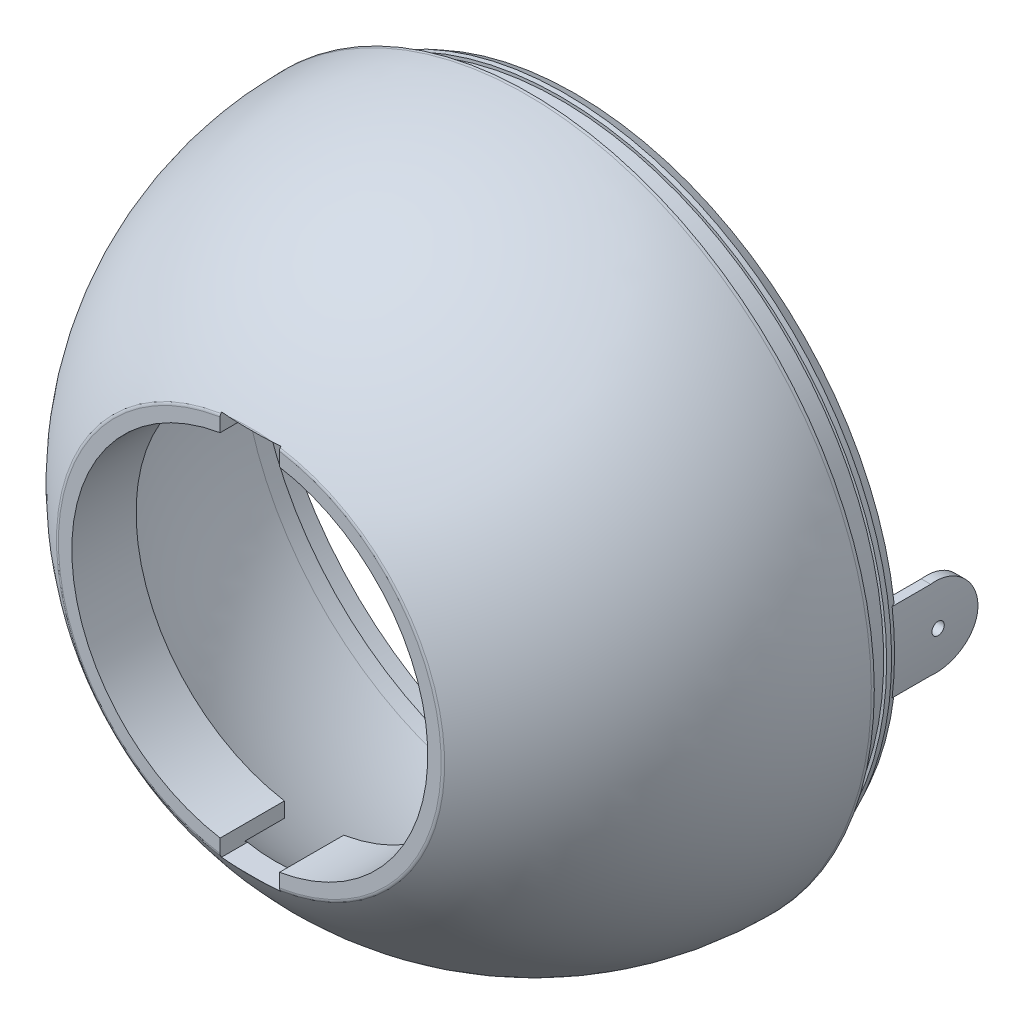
ISO-10303-21;
HEADER;
FILE_DESCRIPTION(('STEP AP214'),'2;1');
FILE_NAME('part.step','',(''),(''),'','','');
FILE_SCHEMA(('AUTOMOTIVE_DESIGN { 1 0 10303 214 1 1 1 1 }'));
ENDSEC;
DATA;
#1=APPLICATION_CONTEXT('core data for automotive mechanical design processes');
#2=APPLICATION_PROTOCOL_DEFINITION('international standard','automotive_design',2000,#1);
#3=PRODUCT_CONTEXT('',#1,'mechanical');
#4=PRODUCT('Part','Part','',(#3));
#5=PRODUCT_RELATED_PRODUCT_CATEGORY('part','',(#4));
#6=PRODUCT_DEFINITION_FORMATION('','',#4);
#7=PRODUCT_DEFINITION_CONTEXT('part definition',#1,'design');
#8=PRODUCT_DEFINITION('design','',#6,#7);
#9=PRODUCT_DEFINITION_SHAPE('','',#8);
#10=(LENGTH_UNIT() NAMED_UNIT(*) SI_UNIT(.MILLI.,.METRE.));
#11=(NAMED_UNIT(*) PLANE_ANGLE_UNIT() SI_UNIT($,.RADIAN.));
#12=(NAMED_UNIT(*) SI_UNIT($,.STERADIAN.) SOLID_ANGLE_UNIT());
#13=UNCERTAINTY_MEASURE_WITH_UNIT(LENGTH_MEASURE(1.E-05),#10,'distance_accuracy_value','');
#14=(GEOMETRIC_REPRESENTATION_CONTEXT(3) GLOBAL_UNCERTAINTY_ASSIGNED_CONTEXT((#13)) GLOBAL_UNIT_ASSIGNED_CONTEXT((#10,
#11,#12)) REPRESENTATION_CONTEXT('',''));
#15=CARTESIAN_POINT('',(0.,0.,0.));
#16=DIRECTION('',(0.,0.,1.));
#17=DIRECTION('',(1.,0.,0.));
#18=AXIS2_PLACEMENT_3D('',#15,#16,#17);
#19=CARTESIAN_POINT('',(-31.5,4.,-6.4));
#20=DIRECTION('',(0.,1.,0.));
#21=DIRECTION('',(0.,0.,1.));
#22=AXIS2_PLACEMENT_3D('',#19,#20,#21);
#23=PLANE('',#22);
#24=CARTESIAN_POINT('',(-32.4544295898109,4.,-2.50000000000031));
#25=CARTESIAN_POINT('',(-32.4208437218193,4.,-2.56666729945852));
#26=CARTESIAN_POINT('',(-32.3872572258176,4.,-2.63333428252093));
#27=CARTESIAN_POINT('',(-32.3200829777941,4.,-2.7666676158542));
#28=CARTESIAN_POINT('',(-32.2864952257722,4.,-2.83333396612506));
#29=CARTESIAN_POINT('',(-32.2529068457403,4.,-2.90000000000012));
#30=B_SPLINE_CURVE_WITH_KNOTS('',3,(#24,#25,#26,#27,#28,#29),.UNSPECIFIED.,.F.,.F.,(4,2,4),(0.,
0.223948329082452,0.447896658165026),.UNSPECIFIED.);
#31=CARTESIAN_POINT('',(-32.4544295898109,4.00000000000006,-2.50000000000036));
#32=VERTEX_POINT('',#31);
#33=CARTESIAN_POINT('',(-32.2529068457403,4.,-2.90000000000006));
#34=VERTEX_POINT('',#33);
#35=EDGE_CURVE('E22',#32,#34,#30,.T.);
#36=ORIENTED_EDGE('',*,*,#35,.T.);
#37=DIRECTION('',(1.,0.,0.));
#38=VECTOR('',#37,1.);
#39=CARTESIAN_POINT('',(-31.5,4.,-2.9));
#40=LINE('',#39,#38);
#41=CARTESIAN_POINT('',(-31.5,4.,-2.9));
#42=VERTEX_POINT('',#41);
#43=EDGE_CURVE('E214',#34,#42,#40,.T.);
#44=ORIENTED_EDGE('',*,*,#43,.T.);
#45=DIRECTION('',(0.,0.,-1.));
#46=VECTOR('',#45,1.);
#47=CARTESIAN_POINT('',(-31.5,4.,0.));
#48=LINE('',#47,#46);
#49=CARTESIAN_POINT('',(-31.5,3.99999999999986,-6.40000000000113));
#50=VERTEX_POINT('',#49);
#51=EDGE_CURVE('E245',#50,#42,#48,.F.);
#52=ORIENTED_EDGE('',*,*,#51,.F.);
#53=DIRECTION('',(1.,0.,0.));
#54=VECTOR('',#53,1.);
#55=CARTESIAN_POINT('',(-31.5,3.99999999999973,-6.40000000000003));
#56=LINE('',#55,#54);
#57=CARTESIAN_POINT('',(-32.454429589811,3.99999999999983,-6.40000000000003));
#58=VERTEX_POINT('',#57);
#59=EDGE_CURVE('E216',#58,#50,#56,.T.);
#60=ORIENTED_EDGE('',*,*,#59,.F.);
#61=DIRECTION('',(0.,0.,-1.));
#62=VECTOR('',#61,1.);
#63=CARTESIAN_POINT('',(-32.454429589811,4.00000000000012,91.11789943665));
#64=LINE('',#63,#62);
#65=EDGE_CURVE('E201',#32,#58,#64,.T.);
#66=ORIENTED_EDGE('',*,*,#65,.F.);
#67=EDGE_LOOP('',(#36,#44,#52,#60,#66));
#68=FACE_BOUND('',#67,.T.);
#69=ADVANCED_FACE('F17',(#68),#23,.T.);
#70=CARTESIAN_POINT('',(-31.5,0.,-6.9));
#71=DIRECTION('',(1.,0.,0.));
#72=DIRECTION('',(0.,0.,-1.));
#73=AXIS2_PLACEMENT_3D('',#70,#71,#72);
#74=CYLINDRICAL_SURFACE('',#73,4.031128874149);
#75=ORIENTED_EDGE('',*,*,#59,.T.);
#76=CARTESIAN_POINT('',(-31.5,0.,-6.9));
#77=DIRECTION('',(1.,0.,0.));
#78=DIRECTION('',(0.,0.,-1.));
#79=AXIS2_PLACEMENT_3D('',#76,#77,#78);
#80=CIRCLE('',#79,4.031128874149);
#81=CARTESIAN_POINT('',(-31.5,-4.,-6.40000000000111));
#82=VERTEX_POINT('',#81);
#83=EDGE_CURVE('E248',#82,#50,#80,.T.);
#84=ORIENTED_EDGE('',*,*,#83,.F.);
#85=DIRECTION('',(1.,0.,0.));
#86=VECTOR('',#85,1.);
#87=CARTESIAN_POINT('',(-31.5,-4.,-6.4));
#88=LINE('',#87,#86);
#89=CARTESIAN_POINT('',(-32.454429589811,-4.00000000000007,-6.40000000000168));
#90=VERTEX_POINT('',#89);
#91=EDGE_CURVE('E264',#90,#82,#88,.T.);
#92=ORIENTED_EDGE('',*,*,#91,.F.);
#93=CARTESIAN_POINT('',(-32.454429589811,3.99999999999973,-6.40000000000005));
#94=CARTESIAN_POINT('',(-32.4527005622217,4.01399211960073,-6.51183592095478));
#95=CARTESIAN_POINT('',(-32.4515521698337,4.02327037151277,-6.62426825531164));
#96=CARTESIAN_POINT('',(-32.4504232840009,4.0323849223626,-6.84951434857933));
#97=CARTESIAN_POINT('',(-32.4504427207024,4.0322217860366,-6.96232808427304));
#98=CARTESIAN_POINT('',(-32.4516553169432,4.02244582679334,-7.18742846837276));
#99=CARTESIAN_POINT('',(-32.4528473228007,4.01284229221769,-7.29971552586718));
#100=CARTESIAN_POINT('',(-32.456366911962,3.98427640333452,-7.52307114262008));
#101=CARTESIAN_POINT('',(-32.4586944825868,3.96531415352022,-7.63413971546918));
#102=CARTESIAN_POINT('',(-32.4644204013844,3.91815930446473,-7.85430520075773));
#103=CARTESIAN_POINT('',(-32.4678189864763,3.88996466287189,-7.96340167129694));
#104=CARTESIAN_POINT('',(-32.4755877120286,3.82456230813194,-8.1788352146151));
#105=CARTESIAN_POINT('',(-32.4799582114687,3.78735126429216,-8.28517125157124));
#106=CARTESIAN_POINT('',(-32.4943456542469,3.66259264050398,-8.59879586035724));
#107=CARTESIAN_POINT('',(-32.5056458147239,3.56186298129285,-8.80096377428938));
#108=CARTESIAN_POINT('',(-32.530438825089,3.32781729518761,-9.18619599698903));
#109=CARTESIAN_POINT('',(-32.5439396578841,3.19438170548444,-9.36918661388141));
#110=CARTESIAN_POINT('',(-32.5715976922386,2.89879444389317,-9.71032135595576));
#111=CARTESIAN_POINT('',(-32.5857550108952,2.73663763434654,-9.86846102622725));
#112=CARTESIAN_POINT('',(-32.613225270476,2.38712763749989,-10.1562503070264));
#113=CARTESIAN_POINT('',(-32.6265329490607,2.19963634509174,-10.2857327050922));
#114=CARTESIAN_POINT('',(-32.6507172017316,1.80543703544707,-10.5113657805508));
#115=CARTESIAN_POINT('',(-32.6615939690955,1.59873054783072,-10.6075191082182));
#116=CARTESIAN_POINT('',(-32.6796691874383,1.17242977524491,-10.7635224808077));
#117=CARTESIAN_POINT('',(-32.6868760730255,0.95286634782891,-10.8234558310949));
#118=CARTESIAN_POINT('',(-32.6968351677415,0.506689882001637,-10.9055854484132));
#119=CARTESIAN_POINT('',(-32.6995874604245,0.280076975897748,-10.9277824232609));
#120=CARTESIAN_POINT('',(-32.7003234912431,-0.172143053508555,-10.9337529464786));
#121=CARTESIAN_POINT('',(-32.6983389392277,-0.397746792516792,-10.9177820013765));
#122=CARTESIAN_POINT('',(-32.6898898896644,-0.843031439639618,-10.8484259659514));
#123=CARTESIAN_POINT('',(-32.6834255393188,-1.06271254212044,-10.7950421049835));
#124=CARTESIAN_POINT('',(-32.6667438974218,-1.48980671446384,-10.6524833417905));
#125=CARTESIAN_POINT('',(-32.656529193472,-1.69722812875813,-10.5633331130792));
#126=CARTESIAN_POINT('',(-32.6334766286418,-2.0942280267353,-10.3517817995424));
#127=CARTESIAN_POINT('',(-32.6206384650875,-2.2838044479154,-10.2293768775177));
#128=CARTESIAN_POINT('',(-32.5936718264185,-2.64100369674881,-9.95390340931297));
#129=CARTESIAN_POINT('',(-32.5795356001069,-2.80847784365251,-9.80064313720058));
#130=CARTESIAN_POINT('',(-32.5516199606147,-3.11542081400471,-9.46812497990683));
#131=CARTESIAN_POINT('',(-32.5378404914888,-3.25489405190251,-9.28887120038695));
#132=CARTESIAN_POINT('',(-32.5185855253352,-3.44027245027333,-9.00415803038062));
#133=CARTESIAN_POINT('',(-32.5123902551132,-3.49819930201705,-8.90637069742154));
#134=CARTESIAN_POINT('',(-32.5006543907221,-3.60560431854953,-8.70623656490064));
#135=CARTESIAN_POINT('',(-32.4951135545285,-3.65508560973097,-8.603891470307));
#136=CARTESIAN_POINT('',(-32.4848433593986,-3.74526569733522,-8.39529601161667));
#137=CARTESIAN_POINT('',(-32.4801144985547,-3.78595910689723,-8.28904329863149));
#138=CARTESIAN_POINT('',(-32.471610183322,-3.85821912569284,-8.07348263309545));
#139=CARTESIAN_POINT('',(-32.4678343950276,-3.88978893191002,-7.96417576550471));
#140=CARTESIAN_POINT('',(-32.4611114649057,-3.94551541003,-7.73531684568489));
#141=CARTESIAN_POINT('',(-32.4582432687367,-3.96897721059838,-7.61559262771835));
#142=CARTESIAN_POINT('',(-32.4538224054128,-4.00496346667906,-7.37447883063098));
#143=CARTESIAN_POINT('',(-32.4522698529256,-4.01748696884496,-7.25308910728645));
#144=CARTESIAN_POINT('',(-32.4505339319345,-4.03149190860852,-7.00944634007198));
#145=CARTESIAN_POINT('',(-32.4503530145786,-4.03295357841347,-6.88719214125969));
#146=CARTESIAN_POINT('',(-32.4513631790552,-4.02479022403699,-6.64305831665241));
#147=CARTESIAN_POINT('',(-32.4525542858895,-4.01516499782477,-6.52117869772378));
#148=CARTESIAN_POINT('',(-32.454429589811,-3.99999999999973,-6.40000000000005));
#149=B_SPLINE_CURVE_WITH_KNOTS('',3,(#93,#94,#95,#96,#97,#98,#99,#100,#101,#102,#103,#104,#105,
#106,#107,#108,#109,#110,#111,#112,#113,#114,#115,#116,#117,#118,#119,#120,#121,#122,#123,#124,
#125,#126,#127,#128,#129,#130,#131,#132,#133,#134,#135,#136,#137,#138,#139,#140,#141,#142,#143,
#144,#145,#146,#147,#148),.UNSPECIFIED.,.F.,.F.,(4,2,2,2,2,2,2,2,2,2,2,2,2,2,2,2,2,2,2,2,2,2,2,
2,2,2,2,4),(0.,0.338059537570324,0.676098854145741,1.01380590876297,1.35150919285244,
1.68928723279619,2.0271902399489,2.70219947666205,3.37971413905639,4.05735011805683,
4.73884148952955,5.42027865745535,6.10014250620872,6.77999360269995,7.45530635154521,
8.1305969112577,8.80542241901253,9.48032582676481,10.1595600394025,10.8386870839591,
11.1798293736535,11.5208451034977,11.8620692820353,12.2031737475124,12.5687654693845,
12.9343890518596,13.3006658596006,13.6669493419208),.UNSPECIFIED.);
#150=EDGE_CURVE('E218',#58,#90,#149,.T.);
#151=ORIENTED_EDGE('',*,*,#150,.F.);
#152=EDGE_LOOP('',(#75,#84,#92,#151));
#153=FACE_BOUND('',#152,.T.);
#154=ADVANCED_FACE('F1065',(#153),#74,.T.);
#155=CARTESIAN_POINT('',(-31.5,-4.,-2.4));
#156=DIRECTION('',(0.,-1.,0.));
#157=DIRECTION('',(0.,0.,-1.));
#158=AXIS2_PLACEMENT_3D('',#155,#156,#157);
#159=PLANE('',#158);
#160=DIRECTION('',(1.,0.,0.));
#161=VECTOR('',#160,1.);
#162=CARTESIAN_POINT('',(-31.5,-4.,-2.9));
#163=LINE('',#162,#161);
#164=CARTESIAN_POINT('',(-31.5,-4.,-2.9));
#165=VERTEX_POINT('',#164);
#166=CARTESIAN_POINT('',(-32.2529068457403,-4.,-2.90000000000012));
#167=VERTEX_POINT('',#166);
#168=EDGE_CURVE('E266',#165,#167,#163,.F.);
#169=ORIENTED_EDGE('',*,*,#168,.T.);
#170=CARTESIAN_POINT('',(-32.2529068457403,-4.,-2.90000000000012));
#171=CARTESIAN_POINT('',(-32.2864952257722,-4.,-2.83333396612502));
#172=CARTESIAN_POINT('',(-32.3200829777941,-4.,-2.76666761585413));
#173=CARTESIAN_POINT('',(-32.3872572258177,-4.,-2.63333428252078));
#174=CARTESIAN_POINT('',(-32.4208437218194,-4.,-2.56666729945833));
#175=CARTESIAN_POINT('',(-32.454429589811,-4.,-2.50000000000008));
#176=B_SPLINE_CURVE_WITH_KNOTS('',3,(#170,#171,#172,#173,#174,#175),.UNSPECIFIED.,.F.,.F.,(4,2,
4),(0.,0.2239483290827,0.447896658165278),.UNSPECIFIED.);
#177=CARTESIAN_POINT('',(-32.454429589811,-4.00000000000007,-2.50000000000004));
#178=VERTEX_POINT('',#177);
#179=EDGE_CURVE('E281',#167,#178,#176,.T.);
#180=ORIENTED_EDGE('',*,*,#179,.T.);
#181=DIRECTION('',(0.,0.,-1.));
#182=VECTOR('',#181,1.);
#183=CARTESIAN_POINT('',(-32.454429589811,-4.00000000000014,91.11789943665));
#184=LINE('',#183,#182);
#185=EDGE_CURVE('E203',#90,#178,#184,.F.);
#186=ORIENTED_EDGE('',*,*,#185,.F.);
#187=ORIENTED_EDGE('',*,*,#91,.T.);
#188=DIRECTION('',(0.,0.,-1.));
#189=VECTOR('',#188,1.);
#190=CARTESIAN_POINT('',(-31.5,-4.,0.));
#191=LINE('',#190,#189);
#192=EDGE_CURVE('E251',#165,#82,#191,.T.);
#193=ORIENTED_EDGE('',*,*,#192,.F.);
#194=EDGE_LOOP('',(#169,#180,#186,#187,#193));
#195=FACE_BOUND('',#194,.T.);
#196=ADVANCED_FACE('F1058',(#195),#159,.T.);
#197=CARTESIAN_POINT('',(-31.5,0.,-6.9));
#198=DIRECTION('',(1.,0.,0.));
#199=DIRECTION('',(0.,0.,-1.));
#200=AXIS2_PLACEMENT_3D('',#197,#198,#199);
#201=CYLINDRICAL_SURFACE('',#200,0.625);
#202=CARTESIAN_POINT('',(-32.6940265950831,0.625,-6.9));
#203=CARTESIAN_POINT('',(-32.6940267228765,0.624997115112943,-6.86491716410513));
#204=CARTESIAN_POINT('',(-32.6940836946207,0.622035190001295,-6.82980257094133));
#205=CARTESIAN_POINT('',(-32.6943057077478,0.610251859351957,-6.76051041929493));
#206=CARTESIAN_POINT('',(-32.6944709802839,0.601417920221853,-6.72633502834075));
#207=CARTESIAN_POINT('',(-32.6948908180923,0.578142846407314,-6.65997861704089));
#208=CARTESIAN_POINT('',(-32.6951453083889,0.563706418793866,-6.62779594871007));
#209=CARTESIAN_POINT('',(-32.6957148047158,0.529643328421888,-6.5663275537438));
#210=CARTESIAN_POINT('',(-32.6960297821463,0.510019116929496,-6.53704046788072));
#211=CARTESIAN_POINT('',(-32.6966849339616,0.466127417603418,-6.48216638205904));
#212=CARTESIAN_POINT('',(-32.6970251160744,0.441858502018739,-6.45658052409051));
#213=CARTESIAN_POINT('',(-32.6976922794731,0.389367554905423,-6.40984396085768));
#214=CARTESIAN_POINT('',(-32.6980192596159,0.361145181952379,-6.38869363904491));
#215=CARTESIAN_POINT('',(-32.6986231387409,0.301548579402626,-6.35143043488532));
#216=CARTESIAN_POINT('',(-32.6989000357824,0.270174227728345,-6.33531774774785));
#217=CARTESIAN_POINT('',(-32.6993725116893,0.205165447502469,-6.30858874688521));
#218=CARTESIAN_POINT('',(-32.6995680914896,0.171531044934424,-6.29797236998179));
#219=CARTESIAN_POINT('',(-32.69985586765,0.102960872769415,-6.28253831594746));
#220=CARTESIAN_POINT('',(-32.6999480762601,0.068025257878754,-6.27771995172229));
#221=CARTESIAN_POINT('',(-32.7000187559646,-0.0021591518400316,-6.27401659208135));
#222=CARTESIAN_POINT('',(-32.6999972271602,-0.0374079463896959,-6.27513159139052));
#223=CARTESIAN_POINT('',(-32.699842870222,-0.107213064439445,-6.28326268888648));
#224=CARTESIAN_POINT('',(-32.6997100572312,-0.141769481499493,-6.29027798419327));
#225=CARTESIAN_POINT('',(-32.6993481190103,-0.209214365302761,-6.31000940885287));
#226=CARTESIAN_POINT('',(-32.6991189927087,-0.242102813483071,-6.32272560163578));
#227=CARTESIAN_POINT('',(-32.6985902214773,-0.30528145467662,-6.35349930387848));
#228=CARTESIAN_POINT('',(-32.6982905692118,-0.335571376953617,-6.37155736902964));
#229=CARTESIAN_POINT('',(-32.6976545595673,-0.392687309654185,-6.41250007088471));
#230=CARTESIAN_POINT('',(-32.6973182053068,-0.419513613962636,-6.43538429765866));
#231=CARTESIAN_POINT('',(-32.6966466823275,-0.468943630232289,-6.48532978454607));
#232=CARTESIAN_POINT('',(-32.6963115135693,-0.491547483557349,-6.51239090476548));
#233=CARTESIAN_POINT('',(-32.6956799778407,-0.531901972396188,-6.56993841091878));
#234=CARTESIAN_POINT('',(-32.6953836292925,-0.549650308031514,-6.60042641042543));
#235=CARTESIAN_POINT('',(-32.6948631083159,-0.579788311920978,-6.66397261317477));
#236=CARTESIAN_POINT('',(-32.6946389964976,-0.59217348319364,-6.69703294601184));
#237=CARTESIAN_POINT('',(-32.6942891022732,-0.611189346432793,-6.76470988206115));
#238=CARTESIAN_POINT('',(-32.6941631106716,-0.617832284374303,-6.79932300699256));
#239=CARTESIAN_POINT('',(-32.69404873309,-0.623842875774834,-6.85606676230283));
#240=CARTESIAN_POINT('',(-32.6940265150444,-0.6250018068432,-6.87802715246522));
#241=CARTESIAN_POINT('',(-32.6940267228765,-0.624997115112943,-6.93508283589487));
#242=CARTESIAN_POINT('',(-32.6940836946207,-0.622035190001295,-6.97019742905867));
#243=CARTESIAN_POINT('',(-32.6943057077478,-0.610251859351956,-7.03948958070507));
#244=CARTESIAN_POINT('',(-32.6944709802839,-0.601417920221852,-7.07366497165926));
#245=CARTESIAN_POINT('',(-32.6948908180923,-0.578142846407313,-7.14002138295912));
#246=CARTESIAN_POINT('',(-32.6951453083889,-0.563706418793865,-7.17220405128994));
#247=CARTESIAN_POINT('',(-32.6957148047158,-0.529643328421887,-7.2336724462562));
#248=CARTESIAN_POINT('',(-32.6960297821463,-0.510019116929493,-7.26295953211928));
#249=CARTESIAN_POINT('',(-32.6966849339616,-0.466127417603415,-7.31783361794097));
#250=CARTESIAN_POINT('',(-32.6970251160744,-0.441858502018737,-7.34341947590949));
#251=CARTESIAN_POINT('',(-32.6976922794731,-0.38936755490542,-7.39015603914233));
#252=CARTESIAN_POINT('',(-32.6980192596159,-0.361145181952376,-7.4113063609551));
#253=CARTESIAN_POINT('',(-32.6986231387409,-0.301548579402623,-7.44856956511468));
#254=CARTESIAN_POINT('',(-32.6989000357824,-0.270174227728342,-7.46468225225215));
#255=CARTESIAN_POINT('',(-32.6993725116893,-0.205165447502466,-7.4914112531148));
#256=CARTESIAN_POINT('',(-32.6995680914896,-0.171531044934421,-7.50202763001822));
#257=CARTESIAN_POINT('',(-32.69985586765,-0.102960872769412,-7.51746168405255));
#258=CARTESIAN_POINT('',(-32.6999480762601,-0.0680252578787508,-7.52228004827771));
#259=CARTESIAN_POINT('',(-32.7000187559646,0.0021591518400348,-7.52598340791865));
#260=CARTESIAN_POINT('',(-32.6999972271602,0.0374079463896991,-7.52486840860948));
#261=CARTESIAN_POINT('',(-32.699842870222,0.107213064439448,-7.51673731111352));
#262=CARTESIAN_POINT('',(-32.6997100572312,0.141769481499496,-7.50972201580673));
#263=CARTESIAN_POINT('',(-32.6993481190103,0.209214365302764,-7.48999059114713));
#264=CARTESIAN_POINT('',(-32.6991189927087,0.242102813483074,-7.47727439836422));
#265=CARTESIAN_POINT('',(-32.6985902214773,0.305281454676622,-7.44650069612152));
#266=CARTESIAN_POINT('',(-32.6982905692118,0.33557137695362,-7.42844263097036));
#267=CARTESIAN_POINT('',(-32.6976545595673,0.392687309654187,-7.38749992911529));
#268=CARTESIAN_POINT('',(-32.6973182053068,0.419513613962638,-7.36461570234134));
#269=CARTESIAN_POINT('',(-32.6966466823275,0.468943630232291,-7.31467021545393));
#270=CARTESIAN_POINT('',(-32.6963115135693,0.491547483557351,-7.28760909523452));
#271=CARTESIAN_POINT('',(-32.6956799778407,0.53190197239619,-7.23006158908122));
#272=CARTESIAN_POINT('',(-32.6953836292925,0.549650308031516,-7.19957358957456));
#273=CARTESIAN_POINT('',(-32.6948631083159,0.579788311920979,-7.13602738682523));
#274=CARTESIAN_POINT('',(-32.6946389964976,0.592173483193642,-7.10296705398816));
#275=CARTESIAN_POINT('',(-32.6942891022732,0.611189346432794,-7.03529011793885));
#276=CARTESIAN_POINT('',(-32.6941631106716,0.617832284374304,-7.00067699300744));
#277=CARTESIAN_POINT('',(-32.69404873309,0.623842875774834,-6.94393323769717));
#278=CARTESIAN_POINT('',(-32.6940265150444,0.6250018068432,-6.92197284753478));
#279=CARTESIAN_POINT('',(-32.6940265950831,0.625,-6.9));
#280=B_SPLINE_CURVE_WITH_KNOTS('',3,(#202,#203,#204,#205,#206,#207,#208,#209,#210,#211,#212,
#213,#214,#215,#216,#217,#218,#219,#220,#221,#222,#223,#224,#225,#226,#227,#228,#229,#230,#231,
#232,#233,#234,#235,#236,#237,#238,#239,#240,#241,#242,#243,#244,#245,#246,#247,#248,#249,#250,
#251,#252,#253,#254,#255,#256,#257,#258,#259,#260,#261,#262,#263,#264,#265,#266,#267,#268,#269,
#270,#271,#272,#273,#274,#275,#276,#277,#278,#279),.UNSPECIFIED.,.T.,.F.,(4,2,2,2,2,2,2,2,2,2,2,
2,2,2,2,2,2,2,2,2,2,2,2,2,2,2,2,2,2,2,2,2,2,2,2,2,2,2,4),(0.,0.10517958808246,0.210584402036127,
0.315900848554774,0.421167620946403,0.526466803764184,0.631775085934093,0.737087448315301,
0.842398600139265,0.947697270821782,1.05299584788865,1.1582800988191,1.26356552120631,
1.36886189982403,1.47414933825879,1.57943325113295,1.68476694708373,1.79018879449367,
1.8953852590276,1.9612606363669,2.06644022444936,2.17184503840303,2.27716148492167,
2.3824282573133,2.48772744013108,2.59303572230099,2.6983480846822,2.80365923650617,
2.90895790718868,3.01425648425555,3.119540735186,3.22482615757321,3.33012253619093,
3.43540997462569,3.54069388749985,3.64602758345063,3.75144943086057,3.8566458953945,
3.92252127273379),.UNSPECIFIED.);
#281=CARTESIAN_POINT('',(-32.6940265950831,0.625,-6.9));
#282=VERTEX_POINT('',#281);
#283=EDGE_CURVE('E621',#282,#282,#280,.T.);
#284=ORIENTED_EDGE('',*,*,#283,.F.);
#285=EDGE_LOOP('',(#284));
#286=FACE_BOUND('',#285,.T.);
#287=CARTESIAN_POINT('',(-31.5,0.,-6.9));
#288=DIRECTION('',(1.,0.,0.));
#289=DIRECTION('',(0.,0.,-1.));
#290=AXIS2_PLACEMENT_3D('',#287,#288,#289);
#291=CIRCLE('',#290,0.625);
#292=CARTESIAN_POINT('',(-31.5,0.,-7.525));
#293=VERTEX_POINT('',#292);
#294=EDGE_CURVE('E242',#293,#293,#291,.F.);
#295=ORIENTED_EDGE('',*,*,#294,.F.);
#296=EDGE_LOOP('',(#295));
#297=FACE_BOUND('',#296,.T.);
#298=ADVANCED_FACE('F644',(#286,#297),#201,.F.);
#299=CARTESIAN_POINT('',(31.5,-4.,-2.4));
#300=DIRECTION('',(0.,1.,0.));
#301=DIRECTION('',(0.,0.,1.));
#302=AXIS2_PLACEMENT_3D('',#299,#300,#301);
#303=PLANE('',#302);
#304=DIRECTION('',(0.,0.,-1.));
#305=VECTOR('',#304,1.);
#306=CARTESIAN_POINT('',(31.5,-4.,0.));
#307=LINE('',#306,#305);
#308=CARTESIAN_POINT('',(31.5,-4.,-2.9));
#309=VERTEX_POINT('',#308);
#310=CARTESIAN_POINT('',(31.5,-3.99999999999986,-6.40000000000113));
#311=VERTEX_POINT('',#310);
#312=EDGE_CURVE('E240',#309,#311,#307,.T.);
#313=ORIENTED_EDGE('',*,*,#312,.T.);
#314=DIRECTION('',(1.,0.,0.));
#315=VECTOR('',#314,1.);
#316=CARTESIAN_POINT('',(31.5,-3.99999999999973,-6.40000000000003));
#317=LINE('',#316,#315);
#318=CARTESIAN_POINT('',(32.454429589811,-3.99999999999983,-6.40000000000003));
#319=VERTEX_POINT('',#318);
#320=EDGE_CURVE('E260',#319,#311,#317,.F.);
#321=ORIENTED_EDGE('',*,*,#320,.F.);
#322=DIRECTION('',(0.,0.,1.));
#323=VECTOR('',#322,1.);
#324=CARTESIAN_POINT('',(32.454429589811,-4.00000000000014,91.11789943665));
#325=LINE('',#324,#323);
#326=CARTESIAN_POINT('',(32.4544295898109,-4.00000000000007,-2.50000000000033));
#327=VERTEX_POINT('',#326);
#328=EDGE_CURVE('E619',#327,#319,#325,.F.);
#329=ORIENTED_EDGE('',*,*,#328,.F.);
#330=CARTESIAN_POINT('',(32.2529068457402,-4.,-2.90000000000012));
#331=CARTESIAN_POINT('',(32.2864952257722,-4.,-2.83333396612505));
#332=CARTESIAN_POINT('',(32.3200829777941,-4.,-2.76666761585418));
#333=CARTESIAN_POINT('',(32.3872572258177,-4.,-2.63333428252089));
#334=CARTESIAN_POINT('',(32.4208437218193,-4.,-2.56666729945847));
#335=CARTESIAN_POINT('',(32.4544295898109,-4.,-2.50000000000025));
#336=B_SPLINE_CURVE_WITH_KNOTS('',3,(#330,#331,#332,#333,#334,#335),.UNSPECIFIED.,.F.,.F.,(4,2,
4),(0.,0.223948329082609,0.447896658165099),.UNSPECIFIED.);
#337=CARTESIAN_POINT('',(32.2529068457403,-4.,-2.90000000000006));
#338=VERTEX_POINT('',#337);
#339=EDGE_CURVE('E273',#338,#327,#336,.T.);
#340=ORIENTED_EDGE('',*,*,#339,.F.);
#341=DIRECTION('',(1.,0.,0.));
#342=VECTOR('',#341,1.);
#343=CARTESIAN_POINT('',(31.5,-4.,-2.9));
#344=LINE('',#343,#342);
#345=EDGE_CURVE('E263',#309,#338,#344,.T.);
#346=ORIENTED_EDGE('',*,*,#345,.F.);
#347=EDGE_LOOP('',(#313,#321,#329,#340,#346));
#348=FACE_BOUND('',#347,.T.);
#349=ADVANCED_FACE('F1045',(#348),#303,.F.);
#350=CARTESIAN_POINT('',(31.5,0.,-6.9));
#351=DIRECTION('',(1.,0.,0.));
#352=DIRECTION('',(0.,0.,-1.));
#353=AXIS2_PLACEMENT_3D('',#350,#351,#352);
#354=CYLINDRICAL_SURFACE('',#353,4.031128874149);
#355=ORIENTED_EDGE('',*,*,#320,.T.);
#356=CARTESIAN_POINT('',(31.5,0.,-6.9));
#357=DIRECTION('',(1.,0.,0.));
#358=DIRECTION('',(0.,0.,-1.));
#359=AXIS2_PLACEMENT_3D('',#356,#357,#358);
#360=CIRCLE('',#359,4.031128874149);
#361=CARTESIAN_POINT('',(31.5,4.,-6.40000000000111));
#362=VERTEX_POINT('',#361);
#363=EDGE_CURVE('E237',#311,#362,#360,.T.);
#364=ORIENTED_EDGE('',*,*,#363,.T.);
#365=DIRECTION('',(1.,0.,0.));
#366=VECTOR('',#365,1.);
#367=CARTESIAN_POINT('',(31.5,4.,-6.4));
#368=LINE('',#367,#366);
#369=CARTESIAN_POINT('',(32.454429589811,4.00000000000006,-6.4000000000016));
#370=VERTEX_POINT('',#369);
#371=EDGE_CURVE('E257',#362,#370,#368,.T.);
#372=ORIENTED_EDGE('',*,*,#371,.T.);
#373=CARTESIAN_POINT('',(32.454429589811,-3.99999999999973,-6.40000000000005));
#374=CARTESIAN_POINT('',(32.4527005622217,-4.01399211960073,-6.51183592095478));
#375=CARTESIAN_POINT('',(32.4515521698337,-4.02327037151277,-6.62426825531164));
#376=CARTESIAN_POINT('',(32.4504232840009,-4.0323849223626,-6.84951434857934));
#377=CARTESIAN_POINT('',(32.4504427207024,-4.0322217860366,-6.96232808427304));
#378=CARTESIAN_POINT('',(32.4516553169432,-4.02244582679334,-7.18742846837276));
#379=CARTESIAN_POINT('',(32.4528473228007,-4.01284229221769,-7.29971552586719));
#380=CARTESIAN_POINT('',(32.456366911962,-3.98427640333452,-7.52307114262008));
#381=CARTESIAN_POINT('',(32.4586944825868,-3.96531415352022,-7.63413971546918));
#382=CARTESIAN_POINT('',(32.4644204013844,-3.91815930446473,-7.85430520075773));
#383=CARTESIAN_POINT('',(32.4678189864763,-3.88996466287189,-7.96340167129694));
#384=CARTESIAN_POINT('',(32.4755877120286,-3.82456230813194,-8.1788352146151));
#385=CARTESIAN_POINT('',(32.4799582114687,-3.78735126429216,-8.28517125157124));
#386=CARTESIAN_POINT('',(32.4943456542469,-3.66259264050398,-8.59879586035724));
#387=CARTESIAN_POINT('',(32.5056458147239,-3.56186298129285,-8.80096377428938));
#388=CARTESIAN_POINT('',(32.530438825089,-3.32781729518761,-9.18619599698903));
#389=CARTESIAN_POINT('',(32.5439396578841,-3.19438170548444,-9.36918661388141));
#390=CARTESIAN_POINT('',(32.5715976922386,-2.89879444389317,-9.71032135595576));
#391=CARTESIAN_POINT('',(32.5857550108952,-2.73663763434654,-9.86846102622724));
#392=CARTESIAN_POINT('',(32.613225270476,-2.38712763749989,-10.1562503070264));
#393=CARTESIAN_POINT('',(32.6265329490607,-2.19963634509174,-10.2857327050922));
#394=CARTESIAN_POINT('',(32.6507172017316,-1.80543703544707,-10.5113657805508));
#395=CARTESIAN_POINT('',(32.6615939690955,-1.59873054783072,-10.6075191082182));
#396=CARTESIAN_POINT('',(32.6796691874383,-1.17242977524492,-10.7635224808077));
#397=CARTESIAN_POINT('',(32.6868760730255,-0.952866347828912,-10.8234558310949));
#398=CARTESIAN_POINT('',(32.6968351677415,-0.506689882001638,-10.9055854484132));
#399=CARTESIAN_POINT('',(32.6995874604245,-0.280076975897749,-10.9277824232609));
#400=CARTESIAN_POINT('',(32.7003234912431,0.172143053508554,-10.9337529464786));
#401=CARTESIAN_POINT('',(32.6983389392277,0.397746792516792,-10.9177820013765));
#402=CARTESIAN_POINT('',(32.6898898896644,0.843031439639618,-10.8484259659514));
#403=CARTESIAN_POINT('',(32.6834255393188,1.06271254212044,-10.7950421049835));
#404=CARTESIAN_POINT('',(32.6667438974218,1.48980671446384,-10.6524833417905));
#405=CARTESIAN_POINT('',(32.656529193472,1.69722812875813,-10.5633331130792));
#406=CARTESIAN_POINT('',(32.6334766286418,2.09422802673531,-10.3517817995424));
#407=CARTESIAN_POINT('',(32.6206384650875,2.2838044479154,-10.2293768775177));
#408=CARTESIAN_POINT('',(32.5936718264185,2.64100369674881,-9.95390340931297));
#409=CARTESIAN_POINT('',(32.5795356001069,2.80847784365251,-9.80064313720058));
#410=CARTESIAN_POINT('',(32.5516199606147,3.11542081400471,-9.46812497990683));
#411=CARTESIAN_POINT('',(32.5378404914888,3.25489405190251,-9.28887120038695));
#412=CARTESIAN_POINT('',(32.5185855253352,3.44027245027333,-9.00415803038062));
#413=CARTESIAN_POINT('',(32.5123902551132,3.49819930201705,-8.90637069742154));
#414=CARTESIAN_POINT('',(32.5006543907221,3.60560431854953,-8.70623656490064));
#415=CARTESIAN_POINT('',(32.4951135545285,3.65508560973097,-8.603891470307));
#416=CARTESIAN_POINT('',(32.4848433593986,3.74526569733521,-8.39529601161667));
#417=CARTESIAN_POINT('',(32.4801144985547,3.78595910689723,-8.2890432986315));
#418=CARTESIAN_POINT('',(32.471610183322,3.85821912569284,-8.07348263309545));
#419=CARTESIAN_POINT('',(32.4678343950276,3.88978893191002,-7.96417576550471));
#420=CARTESIAN_POINT('',(32.4611114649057,3.94551541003,-7.73531684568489));
#421=CARTESIAN_POINT('',(32.4582432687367,3.96897721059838,-7.61559262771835));
#422=CARTESIAN_POINT('',(32.4538224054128,4.00496346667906,-7.37447883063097));
#423=CARTESIAN_POINT('',(32.4522698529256,4.01748696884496,-7.25308910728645));
#424=CARTESIAN_POINT('',(32.4505339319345,4.03149190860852,-7.00944634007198));
#425=CARTESIAN_POINT('',(32.4503530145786,4.03295357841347,-6.88719214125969));
#426=CARTESIAN_POINT('',(32.4513631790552,4.02479022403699,-6.64305831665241));
#427=CARTESIAN_POINT('',(32.4525542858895,4.01516499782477,-6.52117869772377));
#428=CARTESIAN_POINT('',(32.454429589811,3.99999999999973,-6.40000000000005));
#429=B_SPLINE_CURVE_WITH_KNOTS('',3,(#373,#374,#375,#376,#377,#378,#379,#380,#381,#382,#383,
#384,#385,#386,#387,#388,#389,#390,#391,#392,#393,#394,#395,#396,#397,#398,#399,#400,#401,#402,
#403,#404,#405,#406,#407,#408,#409,#410,#411,#412,#413,#414,#415,#416,#417,#418,#419,#420,#421,
#422,#423,#424,#425,#426,#427,#428),.UNSPECIFIED.,.F.,.F.,(4,2,2,2,2,2,2,2,2,2,2,2,2,2,2,2,2,2,
2,2,2,2,2,2,2,2,2,4),(0.,0.338059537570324,0.676098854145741,1.01380590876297,1.35150919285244,
1.68928723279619,2.0271902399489,2.70219947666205,3.37971413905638,4.05735011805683,
4.73884148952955,5.42027865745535,6.10014250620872,6.77999360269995,7.45530635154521,
8.1305969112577,8.80542241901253,9.48032582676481,10.1595600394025,10.8386870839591,
11.1798293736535,11.5208451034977,11.8620692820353,12.2031737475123,12.5687654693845,
12.9343890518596,13.3006658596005,13.6669493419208),.UNSPECIFIED.);
#430=EDGE_CURVE('E618',#319,#370,#429,.T.);
#431=ORIENTED_EDGE('',*,*,#430,.F.);
#432=EDGE_LOOP('',(#355,#364,#372,#431));
#433=FACE_BOUND('',#432,.T.);
#434=ADVANCED_FACE('F1038',(#433),#354,.T.);
#435=CARTESIAN_POINT('',(31.5,4.,-6.4));
#436=DIRECTION('',(0.,-1.,0.));
#437=DIRECTION('',(0.,0.,-1.));
#438=AXIS2_PLACEMENT_3D('',#435,#436,#437);
#439=PLANE('',#438);
#440=DIRECTION('',(0.,0.,1.));
#441=VECTOR('',#440,1.);
#442=CARTESIAN_POINT('',(32.454429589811,4.00000000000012,91.11789943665));
#443=LINE('',#442,#441);
#444=CARTESIAN_POINT('',(32.454429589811,4.00000000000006,-2.5000000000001));
#445=VERTEX_POINT('',#444);
#446=EDGE_CURVE('E616',#370,#445,#443,.T.);
#447=ORIENTED_EDGE('',*,*,#446,.F.);
#448=ORIENTED_EDGE('',*,*,#371,.F.);
#449=DIRECTION('',(0.,0.,-1.));
#450=VECTOR('',#449,1.);
#451=CARTESIAN_POINT('',(31.5,4.,0.));
#452=LINE('',#451,#450);
#453=CARTESIAN_POINT('',(31.5,4.,-2.9));
#454=VERTEX_POINT('',#453);
#455=EDGE_CURVE('E223',#362,#454,#452,.F.);
#456=ORIENTED_EDGE('',*,*,#455,.T.);
#457=DIRECTION('',(1.,0.,0.));
#458=VECTOR('',#457,1.);
#459=CARTESIAN_POINT('',(31.5,4.,-2.9));
#460=LINE('',#459,#458);
#461=CARTESIAN_POINT('',(32.2529068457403,4.,-2.90000000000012));
#462=VERTEX_POINT('',#461);
#463=EDGE_CURVE('E259',#462,#454,#460,.F.);
#464=ORIENTED_EDGE('',*,*,#463,.F.);
#465=CARTESIAN_POINT('',(32.4544295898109,4.,-2.50000000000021));
#466=CARTESIAN_POINT('',(32.4208437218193,4.,-2.56666729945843));
#467=CARTESIAN_POINT('',(32.3872572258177,4.,-2.63333428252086));
#468=CARTESIAN_POINT('',(32.3200829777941,4.,-2.76666761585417));
#469=CARTESIAN_POINT('',(32.2864952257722,4.,-2.83333396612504));
#470=CARTESIAN_POINT('',(32.2529068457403,4.,-2.90000000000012));
#471=B_SPLINE_CURVE_WITH_KNOTS('',3,(#465,#466,#467,#468,#469,#470),.UNSPECIFIED.,.F.,.F.,(4,2,
4),(0.,0.223948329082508,0.447896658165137),.UNSPECIFIED.);
#472=EDGE_CURVE('E254',#445,#462,#471,.T.);
#473=ORIENTED_EDGE('',*,*,#472,.F.);
#474=EDGE_LOOP('',(#447,#448,#456,#464,#473));
#475=FACE_BOUND('',#474,.T.);
#476=ADVANCED_FACE('F667',(#475),#439,.F.);
#477=CARTESIAN_POINT('',(31.5,0.,-6.9));
#478=DIRECTION('',(1.,0.,0.));
#479=DIRECTION('',(0.,0.,-1.));
#480=AXIS2_PLACEMENT_3D('',#477,#478,#479);
#481=CYLINDRICAL_SURFACE('',#480,0.625);
#482=CARTESIAN_POINT('',(32.6940265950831,-0.625,-6.9));
#483=CARTESIAN_POINT('',(32.6940267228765,-0.624997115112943,-6.86491716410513));
#484=CARTESIAN_POINT('',(32.6940836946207,-0.622035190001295,-6.82980257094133));
#485=CARTESIAN_POINT('',(32.6943057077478,-0.610251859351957,-6.76051041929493));
#486=CARTESIAN_POINT('',(32.6944709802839,-0.601417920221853,-6.72633502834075));
#487=CARTESIAN_POINT('',(32.6948908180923,-0.578142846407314,-6.65997861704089));
#488=CARTESIAN_POINT('',(32.6951453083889,-0.563706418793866,-6.62779594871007));
#489=CARTESIAN_POINT('',(32.6957148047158,-0.529643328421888,-6.5663275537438));
#490=CARTESIAN_POINT('',(32.6960297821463,-0.510019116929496,-6.53704046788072));
#491=CARTESIAN_POINT('',(32.6966849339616,-0.466127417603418,-6.48216638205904));
#492=CARTESIAN_POINT('',(32.6970251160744,-0.441858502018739,-6.45658052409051));
#493=CARTESIAN_POINT('',(32.6976922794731,-0.389367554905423,-6.40984396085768));
#494=CARTESIAN_POINT('',(32.6980192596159,-0.361145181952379,-6.38869363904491));
#495=CARTESIAN_POINT('',(32.6986231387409,-0.301548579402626,-6.35143043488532));
#496=CARTESIAN_POINT('',(32.6989000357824,-0.270174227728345,-6.33531774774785));
#497=CARTESIAN_POINT('',(32.6993725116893,-0.205165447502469,-6.30858874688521));
#498=CARTESIAN_POINT('',(32.6995680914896,-0.171531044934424,-6.29797236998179));
#499=CARTESIAN_POINT('',(32.69985586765,-0.102960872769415,-6.28253831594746));
#500=CARTESIAN_POINT('',(32.6999480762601,-0.068025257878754,-6.27771995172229));
#501=CARTESIAN_POINT('',(32.7000187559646,0.0021591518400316,-6.27401659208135));
#502=CARTESIAN_POINT('',(32.6999972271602,0.0374079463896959,-6.27513159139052));
#503=CARTESIAN_POINT('',(32.699842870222,0.107213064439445,-6.28326268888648));
#504=CARTESIAN_POINT('',(32.6997100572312,0.141769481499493,-6.29027798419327));
#505=CARTESIAN_POINT('',(32.6993481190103,0.209214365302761,-6.31000940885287));
#506=CARTESIAN_POINT('',(32.6991189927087,0.242102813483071,-6.32272560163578));
#507=CARTESIAN_POINT('',(32.6985902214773,0.30528145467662,-6.35349930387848));
#508=CARTESIAN_POINT('',(32.6982905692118,0.335571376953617,-6.37155736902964));
#509=CARTESIAN_POINT('',(32.6976545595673,0.392687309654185,-6.41250007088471));
#510=CARTESIAN_POINT('',(32.6973182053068,0.419513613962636,-6.43538429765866));
#511=CARTESIAN_POINT('',(32.6966466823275,0.468943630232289,-6.48532978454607));
#512=CARTESIAN_POINT('',(32.6963115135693,0.491547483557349,-6.51239090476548));
#513=CARTESIAN_POINT('',(32.6956799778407,0.531901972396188,-6.56993841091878));
#514=CARTESIAN_POINT('',(32.6953836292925,0.549650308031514,-6.60042641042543));
#515=CARTESIAN_POINT('',(32.6948631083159,0.579788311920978,-6.66397261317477));
#516=CARTESIAN_POINT('',(32.6946389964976,0.59217348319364,-6.69703294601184));
#517=CARTESIAN_POINT('',(32.6942891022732,0.611189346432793,-6.76470988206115));
#518=CARTESIAN_POINT('',(32.6941631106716,0.617832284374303,-6.79932300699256));
#519=CARTESIAN_POINT('',(32.69404873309,0.623842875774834,-6.85606676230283));
#520=CARTESIAN_POINT('',(32.6940265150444,0.6250018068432,-6.87802715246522));
#521=CARTESIAN_POINT('',(32.6940267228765,0.624997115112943,-6.93508283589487));
#522=CARTESIAN_POINT('',(32.6940836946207,0.622035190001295,-6.97019742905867));
#523=CARTESIAN_POINT('',(32.6943057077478,0.610251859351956,-7.03948958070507));
#524=CARTESIAN_POINT('',(32.6944709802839,0.601417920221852,-7.07366497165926));
#525=CARTESIAN_POINT('',(32.6948908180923,0.578142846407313,-7.14002138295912));
#526=CARTESIAN_POINT('',(32.6951453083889,0.563706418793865,-7.17220405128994));
#527=CARTESIAN_POINT('',(32.6957148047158,0.529643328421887,-7.2336724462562));
#528=CARTESIAN_POINT('',(32.6960297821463,0.510019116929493,-7.26295953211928));
#529=CARTESIAN_POINT('',(32.6966849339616,0.466127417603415,-7.31783361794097));
#530=CARTESIAN_POINT('',(32.6970251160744,0.441858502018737,-7.34341947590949));
#531=CARTESIAN_POINT('',(32.6976922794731,0.38936755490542,-7.39015603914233));
#532=CARTESIAN_POINT('',(32.6980192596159,0.361145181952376,-7.4113063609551));
#533=CARTESIAN_POINT('',(32.6986231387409,0.301548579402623,-7.44856956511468));
#534=CARTESIAN_POINT('',(32.6989000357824,0.270174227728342,-7.46468225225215));
#535=CARTESIAN_POINT('',(32.6993725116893,0.205165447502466,-7.4914112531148));
#536=CARTESIAN_POINT('',(32.6995680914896,0.171531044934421,-7.50202763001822));
#537=CARTESIAN_POINT('',(32.69985586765,0.102960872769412,-7.51746168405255));
#538=CARTESIAN_POINT('',(32.6999480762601,0.0680252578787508,-7.52228004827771));
#539=CARTESIAN_POINT('',(32.7000187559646,-0.0021591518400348,-7.52598340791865));
#540=CARTESIAN_POINT('',(32.6999972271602,-0.0374079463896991,-7.52486840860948));
#541=CARTESIAN_POINT('',(32.699842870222,-0.107213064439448,-7.51673731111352));
#542=CARTESIAN_POINT('',(32.6997100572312,-0.141769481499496,-7.50972201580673));
#543=CARTESIAN_POINT('',(32.6993481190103,-0.209214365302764,-7.48999059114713));
#544=CARTESIAN_POINT('',(32.6991189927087,-0.242102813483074,-7.47727439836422));
#545=CARTESIAN_POINT('',(32.6985902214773,-0.305281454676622,-7.44650069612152));
#546=CARTESIAN_POINT('',(32.6982905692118,-0.33557137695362,-7.42844263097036));
#547=CARTESIAN_POINT('',(32.6976545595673,-0.392687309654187,-7.38749992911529));
#548=CARTESIAN_POINT('',(32.6973182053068,-0.419513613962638,-7.36461570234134));
#549=CARTESIAN_POINT('',(32.6966466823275,-0.468943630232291,-7.31467021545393));
#550=CARTESIAN_POINT('',(32.6963115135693,-0.491547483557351,-7.28760909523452));
#551=CARTESIAN_POINT('',(32.6956799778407,-0.53190197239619,-7.23006158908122));
#552=CARTESIAN_POINT('',(32.6953836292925,-0.549650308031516,-7.19957358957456));
#553=CARTESIAN_POINT('',(32.6948631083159,-0.579788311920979,-7.13602738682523));
#554=CARTESIAN_POINT('',(32.6946389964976,-0.592173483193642,-7.10296705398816));
#555=CARTESIAN_POINT('',(32.6942891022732,-0.611189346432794,-7.03529011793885));
#556=CARTESIAN_POINT('',(32.6941631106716,-0.617832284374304,-7.00067699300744));
#557=CARTESIAN_POINT('',(32.69404873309,-0.623842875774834,-6.94393323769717));
#558=CARTESIAN_POINT('',(32.6940265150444,-0.6250018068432,-6.92197284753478));
#559=CARTESIAN_POINT('',(32.6940265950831,-0.625,-6.9));
#560=B_SPLINE_CURVE_WITH_KNOTS('',3,(#482,#483,#484,#485,#486,#487,#488,#489,#490,#491,#492,
#493,#494,#495,#496,#497,#498,#499,#500,#501,#502,#503,#504,#505,#506,#507,#508,#509,#510,#511,
#512,#513,#514,#515,#516,#517,#518,#519,#520,#521,#522,#523,#524,#525,#526,#527,#528,#529,#530,
#531,#532,#533,#534,#535,#536,#537,#538,#539,#540,#541,#542,#543,#544,#545,#546,#547,#548,#549,
#550,#551,#552,#553,#554,#555,#556,#557,#558,#559),.UNSPECIFIED.,.T.,.F.,(4,2,2,2,2,2,2,2,2,2,2,
2,2,2,2,2,2,2,2,2,2,2,2,2,2,2,2,2,2,2,2,2,2,2,2,2,2,2,4),(0.,0.10517958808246,0.210584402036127,
0.315900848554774,0.421167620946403,0.526466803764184,0.631775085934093,0.737087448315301,
0.842398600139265,0.947697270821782,1.05299584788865,1.1582800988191,1.26356552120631,
1.36886189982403,1.47414933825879,1.57943325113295,1.68476694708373,1.79018879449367,
1.8953852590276,1.9612606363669,2.06644022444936,2.17184503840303,2.27716148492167,
2.3824282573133,2.48772744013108,2.59303572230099,2.6983480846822,2.80365923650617,
2.90895790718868,3.01425648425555,3.119540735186,3.22482615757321,3.33012253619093,
3.43540997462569,3.54069388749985,3.64602758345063,3.75144943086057,3.8566458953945,
3.92252127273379),.UNSPECIFIED.);
#561=CARTESIAN_POINT('',(32.6940265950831,-0.625,-6.9));
#562=VERTEX_POINT('',#561);
#563=EDGE_CURVE('E613',#562,#562,#560,.T.);
#564=ORIENTED_EDGE('',*,*,#563,.F.);
#565=EDGE_LOOP('',(#564));
#566=FACE_BOUND('',#565,.T.);
#567=CARTESIAN_POINT('',(31.5,0.,-6.9));
#568=DIRECTION('',(1.,0.,0.));
#569=DIRECTION('',(0.,0.,-1.));
#570=AXIS2_PLACEMENT_3D('',#567,#568,#569);
#571=CIRCLE('',#570,0.625);
#572=CARTESIAN_POINT('',(31.5,0.,-7.525));
#573=VERTEX_POINT('',#572);
#574=EDGE_CURVE('E219',#573,#573,#571,.F.);
#575=ORIENTED_EDGE('',*,*,#574,.T.);
#576=EDGE_LOOP('',(#575));
#577=FACE_BOUND('',#576,.T.);
#578=ADVANCED_FACE('F662',(#566,#577),#481,.F.);
#579=CARTESIAN_POINT('',(-31.5,0.,0.));
#580=DIRECTION('',(1.,0.,0.));
#581=DIRECTION('',(0.,0.,-1.));
#582=AXIS2_PLACEMENT_3D('',#579,#580,#581);
#583=PLANE('',#582);
#584=ORIENTED_EDGE('',*,*,#294,.T.);
#585=EDGE_LOOP('',(#584));
#586=FACE_BOUND('',#585,.T.);
#587=ORIENTED_EDGE('',*,*,#51,.T.);
#588=DIRECTION('',(0.,1.,0.));
#589=VECTOR('',#588,1.);
#590=CARTESIAN_POINT('',(-31.5,0.,-2.9));
#591=LINE('',#590,#589);
#592=CARTESIAN_POINT('',(-31.5,0.,-2.9));
#593=VERTEX_POINT('',#592);
#594=EDGE_CURVE('E608',#593,#42,#591,.T.);
#595=ORIENTED_EDGE('',*,*,#594,.F.);
#596=DIRECTION('',(0.,1.,0.));
#597=VECTOR('',#596,1.);
#598=CARTESIAN_POINT('',(-31.5,0.,-2.9));
#599=LINE('',#598,#597);
#600=EDGE_CURVE('E598',#165,#593,#599,.T.);
#601=ORIENTED_EDGE('',*,*,#600,.F.);
#602=ORIENTED_EDGE('',*,*,#192,.T.);
#603=ORIENTED_EDGE('',*,*,#83,.T.);
#604=EDGE_LOOP('',(#587,#595,#601,#602,#603));
#605=FACE_BOUND('',#604,.T.);
#606=ADVANCED_FACE('F658',(#586,#605),#583,.T.);
#607=CARTESIAN_POINT('',(31.5,0.,0.));
#608=DIRECTION('',(1.,0.,0.));
#609=DIRECTION('',(0.,0.,-1.));
#610=AXIS2_PLACEMENT_3D('',#607,#608,#609);
#611=PLANE('',#610);
#612=ORIENTED_EDGE('',*,*,#574,.F.);
#613=EDGE_LOOP('',(#612));
#614=FACE_BOUND('',#613,.T.);
#615=ORIENTED_EDGE('',*,*,#363,.F.);
#616=ORIENTED_EDGE('',*,*,#312,.F.);
#617=DIRECTION('',(0.,1.,0.));
#618=VECTOR('',#617,1.);
#619=CARTESIAN_POINT('',(31.5,0.,-2.9));
#620=LINE('',#619,#618);
#621=CARTESIAN_POINT('',(31.5,0.,-2.9));
#622=VERTEX_POINT('',#621);
#623=EDGE_CURVE('E595',#622,#309,#620,.F.);
#624=ORIENTED_EDGE('',*,*,#623,.F.);
#625=DIRECTION('',(0.,1.,0.));
#626=VECTOR('',#625,1.);
#627=CARTESIAN_POINT('',(31.5,0.,-2.9));
#628=LINE('',#627,#626);
#629=EDGE_CURVE('E603',#454,#622,#628,.F.);
#630=ORIENTED_EDGE('',*,*,#629,.F.);
#631=ORIENTED_EDGE('',*,*,#455,.F.);
#632=EDGE_LOOP('',(#615,#616,#624,#630,#631));
#633=FACE_BOUND('',#632,.T.);
#634=ADVANCED_FACE('F652',(#614,#633),#611,.F.);
#635=CARTESIAN_POINT('',(0.,0.,91.11789943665));
#636=DIRECTION('',(0.,0.,-1.));
#637=DIRECTION('',(-1.,0.,0.));
#638=AXIS2_PLACEMENT_3D('',#635,#636,#637);
#639=CYLINDRICAL_SURFACE('',#638,32.7);
#640=ORIENTED_EDGE('',*,*,#283,.T.);
#641=EDGE_LOOP('',(#640));
#642=FACE_BOUND('',#641,.T.);
#643=ORIENTED_EDGE('',*,*,#185,.T.);
#644=CARTESIAN_POINT('',(0.,0.,-2.5));
#645=DIRECTION('',(0.,0.,1.));
#646=DIRECTION('',(-1.,0.,0.));
#647=AXIS2_PLACEMENT_3D('',#644,#645,#646);
#648=CIRCLE('',#647,32.7);
#649=EDGE_CURVE('E196',#32,#178,#648,.T.);
#650=ORIENTED_EDGE('',*,*,#649,.F.);
#651=ORIENTED_EDGE('',*,*,#65,.T.);
#652=ORIENTED_EDGE('',*,*,#150,.T.);
#653=EDGE_LOOP('',(#643,#650,#651,#652));
#654=FACE_BOUND('',#653,.T.);
#655=ADVANCED_FACE('F198',(#642,#654),#639,.T.);
#656=CARTESIAN_POINT('',(0.,0.,91.11789943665));
#657=DIRECTION('',(0.,0.,1.));
#658=DIRECTION('',(1.,0.,0.));
#659=AXIS2_PLACEMENT_3D('',#656,#657,#658);
#660=CYLINDRICAL_SURFACE('',#659,32.7);
#661=ORIENTED_EDGE('',*,*,#563,.T.);
#662=EDGE_LOOP('',(#661));
#663=FACE_BOUND('',#662,.T.);
#664=ORIENTED_EDGE('',*,*,#446,.T.);
#665=CARTESIAN_POINT('',(0.,0.,-2.5000000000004));
#666=DIRECTION('',(0.,0.,1.));
#667=DIRECTION('',(-1.,0.,0.));
#668=AXIS2_PLACEMENT_3D('',#665,#666,#667);
#669=CIRCLE('',#668,32.6999999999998);
#670=EDGE_CURVE('E230',#327,#445,#669,.T.);
#671=ORIENTED_EDGE('',*,*,#670,.F.);
#672=ORIENTED_EDGE('',*,*,#328,.T.);
#673=ORIENTED_EDGE('',*,*,#430,.T.);
#674=EDGE_LOOP('',(#664,#671,#672,#673));
#675=FACE_BOUND('',#674,.T.);
#676=ADVANCED_FACE('F651',(#663,#675),#660,.T.);
#677=CARTESIAN_POINT('',(0.,0.,-2.9));
#678=DIRECTION('',(0.,0.,-1.));
#679=DIRECTION('',(-1.,0.,0.));
#680=AXIS2_PLACEMENT_3D('',#677,#678,#679);
#681=PLANE('',#680);
#682=ORIENTED_EDGE('',*,*,#463,.T.);
#683=ORIENTED_EDGE('',*,*,#629,.T.);
#684=CARTESIAN_POINT('',(0.,0.,-2.9));
#685=DIRECTION('',(0.,0.,-1.));
#686=DIRECTION('',(-1.,0.,0.));
#687=AXIS2_PLACEMENT_3D('',#684,#685,#686);
#688=CIRCLE('',#687,31.5);
#689=EDGE_CURVE('E232',#622,#593,#688,.F.);
#690=ORIENTED_EDGE('',*,*,#689,.T.);
#691=ORIENTED_EDGE('',*,*,#594,.T.);
#692=ORIENTED_EDGE('',*,*,#43,.F.);
#693=CARTESIAN_POINT('',(0.,0.,-2.90000000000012));
#694=DIRECTION('',(0.,0.,1.));
#695=DIRECTION('',(1.,0.,0.));
#696=AXIS2_PLACEMENT_3D('',#693,#694,#695);
#697=CIRCLE('',#696,32.5);
#698=EDGE_CURVE('E206',#462,#34,#697,.T.);
#699=ORIENTED_EDGE('',*,*,#698,.F.);
#700=EDGE_LOOP('',(#682,#683,#690,#691,#692,#699));
#701=FACE_BOUND('',#700,.T.);
#702=ADVANCED_FACE('F786',(#701),#681,.T.);
#703=CARTESIAN_POINT('',(0.,0.,-2.9));
#704=DIRECTION('',(0.,0.,-1.));
#705=DIRECTION('',(-1.,0.,0.));
#706=AXIS2_PLACEMENT_3D('',#703,#704,#705);
#707=PLANE('',#706);
#708=CARTESIAN_POINT('',(0.,0.,-2.9));
#709=DIRECTION('',(0.,0.,-1.));
#710=DIRECTION('',(-1.,0.,0.));
#711=AXIS2_PLACEMENT_3D('',#708,#709,#710);
#712=CIRCLE('',#711,31.5);
#713=EDGE_CURVE('E594',#593,#622,#712,.F.);
#714=ORIENTED_EDGE('',*,*,#713,.T.);
#715=ORIENTED_EDGE('',*,*,#623,.T.);
#716=ORIENTED_EDGE('',*,*,#345,.T.);
#717=CARTESIAN_POINT('',(0.,0.,-2.90000000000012));
#718=DIRECTION('',(0.,0.,1.));
#719=DIRECTION('',(1.,0.,0.));
#720=AXIS2_PLACEMENT_3D('',#717,#718,#719);
#721=CIRCLE('',#720,32.5);
#722=EDGE_CURVE('E205',#167,#338,#721,.T.);
#723=ORIENTED_EDGE('',*,*,#722,.F.);
#724=ORIENTED_EDGE('',*,*,#168,.F.);
#725=ORIENTED_EDGE('',*,*,#600,.T.);
#726=EDGE_LOOP('',(#714,#715,#716,#723,#724,#725));
#727=FACE_BOUND('',#726,.T.);
#728=ADVANCED_FACE('F792',(#727),#707,.T.);
#729=CARTESIAN_POINT('',(0.,0.,-1.89999999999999));
#730=DIRECTION('',(0.,0.,1.));
#731=DIRECTION('',(1.,0.,0.));
#732=AXIS2_PLACEMENT_3D('',#729,#730,#731);
#733=CONICAL_SURFACE('',#732,33.,0.463647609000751);
#734=CARTESIAN_POINT('',(0.,0.,-1.9));
#735=DIRECTION('',(0.,0.,-1.));
#736=DIRECTION('',(-1.,0.,0.));
#737=AXIS2_PLACEMENT_3D('',#734,#735,#736);
#738=CIRCLE('',#737,33.);
#739=CARTESIAN_POINT('',(-33.,0.,-1.9));
#740=VERTEX_POINT('',#739);
#741=EDGE_CURVE('E591',#740,#740,#738,.F.);
#742=ORIENTED_EDGE('',*,*,#741,.F.);
#743=EDGE_LOOP('',(#742));
#744=FACE_BOUND('',#743,.T.);
#745=ORIENTED_EDGE('',*,*,#339,.T.);
#746=ORIENTED_EDGE('',*,*,#670,.T.);
#747=ORIENTED_EDGE('',*,*,#472,.T.);
#748=ORIENTED_EDGE('',*,*,#698,.T.);
#749=ORIENTED_EDGE('',*,*,#35,.F.);
#750=ORIENTED_EDGE('',*,*,#649,.T.);
#751=ORIENTED_EDGE('',*,*,#179,.F.);
#752=ORIENTED_EDGE('',*,*,#722,.T.);
#753=EDGE_LOOP('',(#745,#746,#747,#748,#749,#750,#751,#752));
#754=FACE_BOUND('',#753,.T.);
#755=ADVANCED_FACE('F210',(#744,#754),#733,.T.);
#756=CARTESIAN_POINT('',(0.,0.,91.11789943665));
#757=DIRECTION('',(0.,0.,-1.));
#758=DIRECTION('',(-1.,0.,0.));
#759=AXIS2_PLACEMENT_3D('',#756,#757,#758);
#760=CYLINDRICAL_SURFACE('',#759,31.5);
#761=CARTESIAN_POINT('',(0.,0.,0.450000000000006));
#762=DIRECTION('',(0.,0.,-1.));
#763=DIRECTION('',(-1.,0.,0.));
#764=AXIS2_PLACEMENT_3D('',#761,#762,#763);
#765=CIRCLE('',#764,31.5);
#766=CARTESIAN_POINT('',(-31.5,0.,0.450000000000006));
#767=VERTEX_POINT('',#766);
#768=EDGE_CURVE('E590',#767,#767,#765,.T.);
#769=ORIENTED_EDGE('',*,*,#768,.F.);
#770=EDGE_LOOP('',(#769));
#771=FACE_BOUND('',#770,.T.);
#772=ORIENTED_EDGE('',*,*,#713,.F.);
#773=ORIENTED_EDGE('',*,*,#689,.F.);
#774=EDGE_LOOP('',(#772,#773));
#775=FACE_BOUND('',#774,.T.);
#776=ADVANCED_FACE('F795',(#771,#775),#760,.F.);
#777=CARTESIAN_POINT('',(0.,0.,91.11789943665));
#778=DIRECTION('',(0.,0.,-1.));
#779=DIRECTION('',(-1.,0.,0.));
#780=AXIS2_PLACEMENT_3D('',#777,#778,#779);
#781=CYLINDRICAL_SURFACE('',#780,33.);
#782=ORIENTED_EDGE('',*,*,#741,.T.);
#783=EDGE_LOOP('',(#782));
#784=FACE_BOUND('',#783,.T.);
#785=CARTESIAN_POINT('',(0.,0.,-1.4));
#786=DIRECTION('',(0.,0.,-1.));
#787=DIRECTION('',(-1.,0.,0.));
#788=AXIS2_PLACEMENT_3D('',#785,#786,#787);
#789=CIRCLE('',#788,33.);
#790=CARTESIAN_POINT('',(-33.,0.,-1.4));
#791=VERTEX_POINT('',#790);
#792=EDGE_CURVE('E583',#791,#791,#789,.T.);
#793=ORIENTED_EDGE('',*,*,#792,.T.);
#794=EDGE_LOOP('',(#793));
#795=FACE_BOUND('',#794,.T.);
#796=ADVANCED_FACE('F797',(#784,#795),#781,.T.);
#797=CARTESIAN_POINT('',(0.,0.,0.45));
#798=DIRECTION('',(0.,0.,-1.));
#799=DIRECTION('',(-1.,0.,0.));
#800=AXIS2_PLACEMENT_3D('',#797,#798,#799);
#801=PLANE('',#800);
#802=CARTESIAN_POINT('',(0.,0.,0.45));
#803=DIRECTION('',(0.,0.,1.));
#804=DIRECTION('',(1.,0.,0.));
#805=AXIS2_PLACEMENT_3D('',#802,#803,#804);
#806=CIRCLE('',#805,29.);
#807=CARTESIAN_POINT('',(29.,0.,0.45));
#808=VERTEX_POINT('',#807);
#809=EDGE_CURVE('E688',#808,#808,#806,.T.);
#810=ORIENTED_EDGE('',*,*,#809,.T.);
#811=EDGE_LOOP('',(#810));
#812=FACE_BOUND('',#811,.T.);
#813=ORIENTED_EDGE('',*,*,#768,.T.);
#814=EDGE_LOOP('',(#813));
#815=FACE_BOUND('',#814,.T.);
#816=ADVANCED_FACE('F805',(#812,#815),#801,.T.);
#817=CARTESIAN_POINT('',(0.,0.,23.5));
#818=DIRECTION('',(0.,0.,1.));
#819=DIRECTION('',(1.,0.,0.));
#820=AXIS2_PLACEMENT_3D('',#817,#818,#819);
#821=PLANE('',#820);
#822=DIRECTION('',(0.,1.,0.));
#823=VECTOR('',#822,1.);
#824=CARTESIAN_POINT('',(3.,0.,23.5));
#825=LINE('',#824,#823);
#826=CARTESIAN_POINT('',(3.,19.2678488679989,23.5));
#827=VERTEX_POINT('',#826);
#828=CARTESIAN_POINT('',(3.,17.7482393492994,23.5));
#829=VERTEX_POINT('',#828);
#830=EDGE_CURVE('E586',#827,#829,#825,.F.);
#831=ORIENTED_EDGE('',*,*,#830,.F.);
#832=CARTESIAN_POINT('',(0.,0.,23.5));
#833=DIRECTION('',(0.,0.,1.));
#834=DIRECTION('',(1.,0.,0.));
#835=AXIS2_PLACEMENT_3D('',#832,#833,#834);
#836=CIRCLE('',#835,19.5);
#837=CARTESIAN_POINT('',(3.,-19.2678488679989,23.5));
#838=VERTEX_POINT('',#837);
#839=EDGE_CURVE('E691',#838,#827,#836,.T.);
#840=ORIENTED_EDGE('',*,*,#839,.F.);
#841=DIRECTION('',(0.,1.,0.));
#842=VECTOR('',#841,1.);
#843=CARTESIAN_POINT('',(3.,0.,23.5));
#844=LINE('',#843,#842);
#845=CARTESIAN_POINT('',(3.,-17.7482393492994,23.5));
#846=VERTEX_POINT('',#845);
#847=EDGE_CURVE('E588',#846,#838,#844,.F.);
#848=ORIENTED_EDGE('',*,*,#847,.F.);
#849=CARTESIAN_POINT('',(0.,0.,23.5));
#850=DIRECTION('',(0.,0.,1.));
#851=DIRECTION('',(1.,0.,0.));
#852=AXIS2_PLACEMENT_3D('',#849,#850,#851);
#853=CIRCLE('',#852,18.);
#854=EDGE_CURVE('E694',#846,#829,#853,.T.);
#855=ORIENTED_EDGE('',*,*,#854,.T.);
#856=EDGE_LOOP('',(#831,#840,#848,#855));
#857=FACE_BOUND('',#856,.T.);
#858=ADVANCED_FACE('F765',(#857),#821,.F.);
#859=CARTESIAN_POINT('',(0.,0.,23.5));
#860=DIRECTION('',(0.,0.,1.));
#861=DIRECTION('',(1.,0.,0.));
#862=AXIS2_PLACEMENT_3D('',#859,#860,#861);
#863=PLANE('',#862);
#864=DIRECTION('',(0.,1.,0.));
#865=VECTOR('',#864,1.);
#866=CARTESIAN_POINT('',(-3.,0.,23.5));
#867=LINE('',#866,#865);
#868=CARTESIAN_POINT('',(-3.,17.7482393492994,23.5));
#869=VERTEX_POINT('',#868);
#870=CARTESIAN_POINT('',(-3.,19.2678488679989,23.5));
#871=VERTEX_POINT('',#870);
#872=EDGE_CURVE('E581',#869,#871,#867,.T.);
#873=ORIENTED_EDGE('',*,*,#872,.F.);
#874=CARTESIAN_POINT('',(0.,0.,23.5));
#875=DIRECTION('',(0.,0.,1.));
#876=DIRECTION('',(1.,0.,0.));
#877=AXIS2_PLACEMENT_3D('',#874,#875,#876);
#878=CIRCLE('',#877,18.);
#879=CARTESIAN_POINT('',(-3.,-17.7482393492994,23.5));
#880=VERTEX_POINT('',#879);
#881=EDGE_CURVE('E580',#869,#880,#878,.T.);
#882=ORIENTED_EDGE('',*,*,#881,.T.);
#883=DIRECTION('',(0.,1.,0.));
#884=VECTOR('',#883,1.);
#885=CARTESIAN_POINT('',(-3.,0.,23.5));
#886=LINE('',#885,#884);
#887=CARTESIAN_POINT('',(-3.,-19.2678488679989,23.5));
#888=VERTEX_POINT('',#887);
#889=EDGE_CURVE('E584',#888,#880,#886,.T.);
#890=ORIENTED_EDGE('',*,*,#889,.F.);
#891=CARTESIAN_POINT('',(0.,0.,23.5));
#892=DIRECTION('',(0.,0.,1.));
#893=DIRECTION('',(1.,0.,0.));
#894=AXIS2_PLACEMENT_3D('',#891,#892,#893);
#895=CIRCLE('',#894,19.5);
#896=EDGE_CURVE('E685',#871,#888,#895,.T.);
#897=ORIENTED_EDGE('',*,*,#896,.F.);
#898=EDGE_LOOP('',(#873,#882,#890,#897));
#899=FACE_BOUND('',#898,.T.);
#900=ADVANCED_FACE('F699',(#899),#863,.F.);
#901=CARTESIAN_POINT('',(0.,0.,-1.4));
#902=DIRECTION('',(0.,0.,-1.));
#903=DIRECTION('',(-1.,0.,0.));
#904=AXIS2_PLACEMENT_3D('',#901,#902,#903);
#905=PLANE('',#904);
#906=CARTESIAN_POINT('',(0.,0.,-1.4));
#907=DIRECTION('',(0.,0.,-1.));
#908=DIRECTION('',(-1.,0.,0.));
#909=AXIS2_PLACEMENT_3D('',#906,#907,#908);
#910=CIRCLE('',#909,32.7);
#911=CARTESIAN_POINT('',(-32.7,0.,-1.4));
#912=VERTEX_POINT('',#911);
#913=EDGE_CURVE('E548',#912,#912,#910,.F.);
#914=ORIENTED_EDGE('',*,*,#913,.F.);
#915=EDGE_LOOP('',(#914));
#916=FACE_BOUND('',#915,.T.);
#917=ORIENTED_EDGE('',*,*,#792,.F.);
#918=EDGE_LOOP('',(#917));
#919=FACE_BOUND('',#918,.T.);
#920=ADVANCED_FACE('F868',(#916,#919),#905,.F.);
#921=CARTESIAN_POINT('',(0.,0.,30.));
#922=DIRECTION('',(0.,0.,1.));
#923=DIRECTION('',(1.,0.,0.));
#924=AXIS2_PLACEMENT_3D('',#921,#922,#923);
#925=CYLINDRICAL_SURFACE('',#924,19.5);
#926=ORIENTED_EDGE('',*,*,#896,.T.);
#927=DIRECTION('',(0.,0.,1.));
#928=VECTOR('',#927,1.);
#929=CARTESIAN_POINT('',(-3.,-19.267848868,30.));
#930=LINE('',#929,#928);
#931=CARTESIAN_POINT('',(-3.,-19.2678488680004,27.5000000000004));
#932=VERTEX_POINT('',#931);
#933=EDGE_CURVE('E545',#888,#932,#930,.T.);
#934=ORIENTED_EDGE('',*,*,#933,.T.);
#935=CARTESIAN_POINT('',(-3.23634348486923E-12,-2.87743990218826E-13,27.4999999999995));
#936=DIRECTION('',(0.,0.,-1.));
#937=DIRECTION('',(0.,1.,0.));
#938=AXIS2_PLACEMENT_3D('',#935,#936,#937);
#939=CIRCLE('',#938,19.4999999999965);
#940=CARTESIAN_POINT('',(-3.,19.2678488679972,27.4999999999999));
#941=VERTEX_POINT('',#940);
#942=EDGE_CURVE('E400',#932,#941,#939,.T.);
#943=ORIENTED_EDGE('',*,*,#942,.T.);
#944=DIRECTION('',(0.,0.,1.));
#945=VECTOR('',#944,1.);
#946=CARTESIAN_POINT('',(-3.,19.267848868,30.));
#947=LINE('',#946,#945);
#948=EDGE_CURVE('E553',#941,#871,#947,.F.);
#949=ORIENTED_EDGE('',*,*,#948,.T.);
#950=EDGE_LOOP('',(#926,#934,#943,#949));
#951=FACE_BOUND('',#950,.T.);
#952=ADVANCED_FACE('F865',(#951),#925,.T.);
#953=CARTESIAN_POINT('',(0.,0.,0.));
#954=DIRECTION('',(0.,0.,1.));
#955=DIRECTION('',(1.,0.,0.));
#956=AXIS2_PLACEMENT_3D('',#953,#954,#955);
#957=CYLINDRICAL_SURFACE('',#956,29.);
#958=CARTESIAN_POINT('',(2.71028859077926E-12,0.,1.99999999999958));
#959=DIRECTION('',(0.,0.,1.));
#960=DIRECTION('',(0.,-1.,0.));
#961=AXIS2_PLACEMENT_3D('',#958,#959,#960);
#962=CIRCLE('',#961,28.999999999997);
#963=CARTESIAN_POINT('',(2.71028859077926E-12,-28.999999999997,1.99999999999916));
#964=VERTEX_POINT('',#963);
#965=EDGE_CURVE('E399',#964,#964,#962,.T.);
#966=ORIENTED_EDGE('',*,*,#965,.T.);
#967=EDGE_LOOP('',(#966));
#968=FACE_BOUND('',#967,.T.);
#969=ORIENTED_EDGE('',*,*,#809,.F.);
#970=EDGE_LOOP('',(#969));
#971=FACE_BOUND('',#970,.T.);
#972=ADVANCED_FACE('F867',(#968,#971),#957,.F.);
#973=CARTESIAN_POINT('',(0.,0.,30.));
#974=DIRECTION('',(0.,0.,1.));
#975=DIRECTION('',(1.,0.,0.));
#976=AXIS2_PLACEMENT_3D('',#973,#974,#975);
#977=CYLINDRICAL_SURFACE('',#976,19.5);
#978=CARTESIAN_POINT('',(3.17118293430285E-12,2.81455681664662E-13,27.4999999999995));
#979=DIRECTION('',(0.,0.,-1.));
#980=DIRECTION('',(0.,1.,0.));
#981=AXIS2_PLACEMENT_3D('',#978,#979,#980);
#982=CIRCLE('',#981,19.4999999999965);
#983=CARTESIAN_POINT('',(3.,19.2678488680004,27.5000000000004));
#984=VERTEX_POINT('',#983);
#985=CARTESIAN_POINT('',(3.,-19.2678488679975,27.5000000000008));
#986=VERTEX_POINT('',#985);
#987=EDGE_CURVE('E503',#984,#986,#982,.T.);
#988=ORIENTED_EDGE('',*,*,#987,.T.);
#989=DIRECTION('',(0.,0.,-1.));
#990=VECTOR('',#989,1.);
#991=CARTESIAN_POINT('',(3.,-19.267848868,30.));
#992=LINE('',#991,#990);
#993=EDGE_CURVE('E564',#986,#838,#992,.T.);
#994=ORIENTED_EDGE('',*,*,#993,.T.);
#995=ORIENTED_EDGE('',*,*,#839,.T.);
#996=DIRECTION('',(0.,0.,-1.));
#997=VECTOR('',#996,1.);
#998=CARTESIAN_POINT('',(3.,19.267848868,30.));
#999=LINE('',#998,#997);
#1000=EDGE_CURVE('E571',#827,#984,#999,.F.);
#1001=ORIENTED_EDGE('',*,*,#1000,.T.);
#1002=EDGE_LOOP('',(#988,#994,#995,#1001));
#1003=FACE_BOUND('',#1002,.T.);
#1004=ADVANCED_FACE('F759',(#1003),#977,.T.);
#1005=CARTESIAN_POINT('',(0.,0.,30.));
#1006=DIRECTION('',(0.,0.,1.));
#1007=DIRECTION('',(1.,0.,0.));
#1008=AXIS2_PLACEMENT_3D('',#1005,#1006,#1007);
#1009=CYLINDRICAL_SURFACE('',#1008,18.);
#1010=DIRECTION('',(0.,0.,-1.));
#1011=VECTOR('',#1010,1.);
#1012=CARTESIAN_POINT('',(3.,17.7482393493,30.));
#1013=LINE('',#1012,#1011);
#1014=CARTESIAN_POINT('',(3.,17.7482393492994,30.));
#1015=VERTEX_POINT('',#1014);
#1016=EDGE_CURVE('E573',#1015,#829,#1013,.T.);
#1017=ORIENTED_EDGE('',*,*,#1016,.T.);
#1018=ORIENTED_EDGE('',*,*,#854,.F.);
#1019=DIRECTION('',(0.,0.,-1.));
#1020=VECTOR('',#1019,1.);
#1021=CARTESIAN_POINT('',(3.,-17.7482393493,30.));
#1022=LINE('',#1021,#1020);
#1023=CARTESIAN_POINT('',(3.,-17.7482393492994,30.));
#1024=VERTEX_POINT('',#1023);
#1025=EDGE_CURVE('E567',#846,#1024,#1022,.F.);
#1026=ORIENTED_EDGE('',*,*,#1025,.T.);
#1027=CARTESIAN_POINT('',(0.,0.,30.));
#1028=DIRECTION('',(0.,0.,1.));
#1029=DIRECTION('',(1.,0.,0.));
#1030=AXIS2_PLACEMENT_3D('',#1027,#1028,#1029);
#1031=CIRCLE('',#1030,18.);
#1032=EDGE_CURVE('E546',#1015,#1024,#1031,.F.);
#1033=ORIENTED_EDGE('',*,*,#1032,.F.);
#1034=EDGE_LOOP('',(#1017,#1018,#1026,#1033));
#1035=FACE_BOUND('',#1034,.T.);
#1036=ADVANCED_FACE('F768',(#1035),#1009,.F.);
#1037=CARTESIAN_POINT('',(0.,0.,30.));
#1038=DIRECTION('',(0.,0.,1.));
#1039=DIRECTION('',(1.,0.,0.));
#1040=AXIS2_PLACEMENT_3D('',#1037,#1038,#1039);
#1041=CYLINDRICAL_SURFACE('',#1040,18.);
#1042=DIRECTION('',(0.,0.,1.));
#1043=VECTOR('',#1042,1.);
#1044=CARTESIAN_POINT('',(-3.,17.7482393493,30.));
#1045=LINE('',#1044,#1043);
#1046=CARTESIAN_POINT('',(-3.,17.7482393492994,30.));
#1047=VERTEX_POINT('',#1046);
#1048=EDGE_CURVE('E550',#869,#1047,#1045,.T.);
#1049=ORIENTED_EDGE('',*,*,#1048,.T.);
#1050=CARTESIAN_POINT('',(0.,0.,30.));
#1051=DIRECTION('',(0.,0.,1.));
#1052=DIRECTION('',(1.,0.,0.));
#1053=AXIS2_PLACEMENT_3D('',#1050,#1051,#1052);
#1054=CIRCLE('',#1053,18.);
#1055=CARTESIAN_POINT('',(-3.,-17.7482393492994,30.));
#1056=VERTEX_POINT('',#1055);
#1057=EDGE_CURVE('E375',#1056,#1047,#1054,.F.);
#1058=ORIENTED_EDGE('',*,*,#1057,.F.);
#1059=DIRECTION('',(0.,0.,1.));
#1060=VECTOR('',#1059,1.);
#1061=CARTESIAN_POINT('',(-3.,-17.7482393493,30.));
#1062=LINE('',#1061,#1060);
#1063=EDGE_CURVE('E547',#1056,#880,#1062,.F.);
#1064=ORIENTED_EDGE('',*,*,#1063,.T.);
#1065=ORIENTED_EDGE('',*,*,#881,.F.);
#1066=EDGE_LOOP('',(#1049,#1058,#1064,#1065));
#1067=FACE_BOUND('',#1066,.T.);
#1068=ADVANCED_FACE('F702',(#1067),#1041,.F.);
#1069=CARTESIAN_POINT('',(3.,17.7482393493,30.));
#1070=DIRECTION('',(1.,0.,0.));
#1071=DIRECTION('',(0.,0.,-1.));
#1072=AXIS2_PLACEMENT_3D('',#1069,#1070,#1071);
#1073=PLANE('',#1072);
#1074=CARTESIAN_POINT('',(3.,19.4999999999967,29.8523135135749));
#1075=CARTESIAN_POINT('',(3.,19.4822904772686,29.8636832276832));
#1076=CARTESIAN_POINT('',(3.,19.464570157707,29.8750360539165));
#1077=CARTESIAN_POINT('',(3.,19.429107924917,29.8977079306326));
#1078=CARTESIAN_POINT('',(3.,19.4113660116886,29.9090269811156));
#1079=CARTESIAN_POINT('',(3.,19.3936133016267,29.9203291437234));
#1080=B_SPLINE_CURVE_WITH_KNOTS('',3,(#1074,#1075,#1076,#1077,#1078,#1079),.UNSPECIFIED.,.F.,
.F.,(4,2,4),(0.,0.0631353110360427,0.126270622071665),.UNSPECIFIED.);
#1081=CARTESIAN_POINT('',(2.99999999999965,19.4999999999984,29.8523135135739));
#1082=VERTEX_POINT('',#1081);
#1083=CARTESIAN_POINT('',(3.,19.3936133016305,29.9203291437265));
#1084=VERTEX_POINT('',#1083);
#1085=EDGE_CURVE('E436',#1082,#1084,#1080,.T.);
#1086=ORIENTED_EDGE('',*,*,#1085,.F.);
#1087=DIRECTION('',(0.,0.,1.));
#1088=VECTOR('',#1087,1.);
#1089=CARTESIAN_POINT('',(3.,19.5,30.));
#1090=LINE('',#1089,#1088);
#1091=CARTESIAN_POINT('',(3.,19.5000000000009,27.2323934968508));
#1092=VERTEX_POINT('',#1091);
#1093=EDGE_CURVE('E374',#1082,#1092,#1090,.F.);
#1094=ORIENTED_EDGE('',*,*,#1093,.T.);
#1095=CARTESIAN_POINT('',(3.,19.5000000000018,27.2323934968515));
#1096=CARTESIAN_POINT('',(3.,19.4615132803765,27.2771725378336));
#1097=CARTESIAN_POINT('',(3.,19.4229239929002,27.3218626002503));
#1098=CARTESIAN_POINT('',(3.,19.3455402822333,27.411064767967));
#1099=CARTESIAN_POINT('',(3.,19.3067458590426,27.455576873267));
#1100=CARTESIAN_POINT('',(3.,19.2678488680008,27.5000000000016));
#1101=B_SPLINE_CURVE_WITH_KNOTS('',3,(#1095,#1096,#1097,#1098,#1099,#1100),.UNSPECIFIED.,.F.,
.F.,(4,2,4),(0.,0.177135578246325,0.354271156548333),.UNSPECIFIED.);
#1102=EDGE_CURVE('E401',#1092,#984,#1101,.T.);
#1103=ORIENTED_EDGE('',*,*,#1102,.T.);
#1104=ORIENTED_EDGE('',*,*,#1000,.F.);
#1105=ORIENTED_EDGE('',*,*,#830,.T.);
#1106=ORIENTED_EDGE('',*,*,#1016,.F.);
#1107=DIRECTION('',(0.,1.,0.));
#1108=VECTOR('',#1107,1.);
#1109=CARTESIAN_POINT('',(3.,0.,30.));
#1110=LINE('',#1109,#1108);
#1111=CARTESIAN_POINT('',(3.,19.11956382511,30.));
#1112=VERTEX_POINT('',#1111);
#1113=EDGE_CURVE('E515',#1112,#1015,#1110,.F.);
#1114=ORIENTED_EDGE('',*,*,#1113,.F.);
#1115=CARTESIAN_POINT('',(2.99999999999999,19.3936133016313,29.9203291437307));
#1116=CARTESIAN_POINT('',(2.99999999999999,19.3691453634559,29.9359392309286));
#1117=CARTESIAN_POINT('',(3.,19.3433077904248,29.949401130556));
#1118=CARTESIAN_POINT('',(3.,19.2903488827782,29.9714954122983));
#1119=CARTESIAN_POINT('',(3.00000000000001,19.2632713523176,29.9802327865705));
#1120=CARTESIAN_POINT('',(3.00000000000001,19.2168091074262,29.9910578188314));
#1121=CARTESIAN_POINT('',(3.,19.1977022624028,29.9943748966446));
#1122=CARTESIAN_POINT('',(3.,19.1589234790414,29.9988647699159));
#1123=CARTESIAN_POINT('',(3.,19.1392474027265,30.0000018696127));
#1124=CARTESIAN_POINT('',(3.,19.11956382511,30.));
#1125=B_SPLINE_CURVE_WITH_KNOTS('',3,(#1115,#1116,#1117,#1118,#1119,#1120,#1121,#1122,#1123,
#1124),.UNSPECIFIED.,.F.,.F.,(4,2,2,2,4),(0.,0.0869702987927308,0.17191889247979,
0.229979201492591,0.288982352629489),.UNSPECIFIED.);
#1126=EDGE_CURVE('E433',#1084,#1112,#1125,.T.);
#1127=ORIENTED_EDGE('',*,*,#1126,.F.);
#1128=EDGE_LOOP('',(#1086,#1094,#1103,#1104,#1105,#1106,#1114,#1127));
#1129=FACE_BOUND('',#1128,.T.);
#1130=ADVANCED_FACE('F412',(#1129),#1073,.F.);
#1131=CARTESIAN_POINT('',(-3.,19.5,30.));
#1132=DIRECTION('',(-1.,0.,0.));
#1133=DIRECTION('',(0.,0.,1.));
#1134=AXIS2_PLACEMENT_3D('',#1131,#1132,#1133);
#1135=PLANE('',#1134);
#1136=ORIENTED_EDGE('',*,*,#872,.T.);
#1137=ORIENTED_EDGE('',*,*,#948,.F.);
#1138=CARTESIAN_POINT('',(-3.,19.2678488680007,27.5000000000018));
#1139=CARTESIAN_POINT('',(-3.,19.3067458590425,27.4555768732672));
#1140=CARTESIAN_POINT('',(-3.,19.3455402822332,27.4110647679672));
#1141=CARTESIAN_POINT('',(-3.,19.4229239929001,27.3218626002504));
#1142=CARTESIAN_POINT('',(-3.,19.4615132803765,27.2771725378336));
#1143=CARTESIAN_POINT('',(-3.,19.5000000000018,27.2323934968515));
#1144=B_SPLINE_CURVE_WITH_KNOTS('',3,(#1138,#1139,#1140,#1141,#1142,#1143),.UNSPECIFIED.,.F.,
.F.,(4,2,4),(0.,0.177135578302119,0.354271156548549),.UNSPECIFIED.);
#1145=CARTESIAN_POINT('',(-3.00000000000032,19.5000000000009,27.2323934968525));
#1146=VERTEX_POINT('',#1145);
#1147=EDGE_CURVE('E393',#941,#1146,#1144,.T.);
#1148=ORIENTED_EDGE('',*,*,#1147,.T.);
#1149=DIRECTION('',(0.,0.,1.));
#1150=VECTOR('',#1149,1.);
#1151=CARTESIAN_POINT('',(-3.,19.5,30.));
#1152=LINE('',#1151,#1150);
#1153=CARTESIAN_POINT('',(-3.,19.4999999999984,29.8523135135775));
#1154=VERTEX_POINT('',#1153);
#1155=EDGE_CURVE('E366',#1146,#1154,#1152,.T.);
#1156=ORIENTED_EDGE('',*,*,#1155,.T.);
#1157=CARTESIAN_POINT('',(-3.,19.3936133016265,29.9203291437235));
#1158=CARTESIAN_POINT('',(-3.,19.4113660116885,29.9090269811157));
#1159=CARTESIAN_POINT('',(-3.,19.4291079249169,29.8977079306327));
#1160=CARTESIAN_POINT('',(-3.,19.464570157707,29.8750360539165));
#1161=CARTESIAN_POINT('',(-3.,19.4822904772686,29.8636832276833));
#1162=CARTESIAN_POINT('',(-3.,19.4999999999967,29.8523135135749));
#1163=B_SPLINE_CURVE_WITH_KNOTS('',3,(#1157,#1158,#1159,#1160,#1161,#1162),.UNSPECIFIED.,.F.,
.F.,(4,2,4),(0.,0.063135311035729,0.126270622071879),.UNSPECIFIED.);
#1164=CARTESIAN_POINT('',(-2.99999999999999,19.3936133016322,29.9203291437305));
#1165=VERTEX_POINT('',#1164);
#1166=EDGE_CURVE('E420',#1165,#1154,#1163,.T.);
#1167=ORIENTED_EDGE('',*,*,#1166,.F.);
#1168=CARTESIAN_POINT('',(-3.,19.11956382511,30.));
#1169=CARTESIAN_POINT('',(-3.00000000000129,19.1485861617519,30.0000272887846));
#1170=CARTESIAN_POINT('',(-3.00000000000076,19.1776168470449,29.9975352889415));
#1171=CARTESIAN_POINT('',(-2.99999999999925,19.2341755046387,29.9878077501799));
#1172=CARTESIAN_POINT('',(-2.99999999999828,19.2617227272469,29.9806840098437));
#1173=CARTESIAN_POINT('',(-2.99999999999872,19.3067532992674,29.9649331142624));
#1174=CARTESIAN_POINT('',(-2.99999999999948,19.3246612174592,29.9574963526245));
#1175=CARTESIAN_POINT('',(-3.00000000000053,19.3597981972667,29.9404966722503));
#1176=CARTESIAN_POINT('',(-3.0000000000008,19.3770114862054,29.9309011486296));
#1177=CARTESIAN_POINT('',(-2.99999999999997,19.3936133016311,29.9203291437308));
#1178=B_SPLINE_CURVE_WITH_KNOTS('',3,(#1168,#1169,#1170,#1171,#1172,#1173,#1174,#1175,#1176,
#1177),.UNSPECIFIED.,.F.,.F.,(4,2,2,2,4),(0.,0.0869795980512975,0.171933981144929,
0.229986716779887,0.288983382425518),.UNSPECIFIED.);
#1179=CARTESIAN_POINT('',(-3.,19.11956382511,30.));
#1180=VERTEX_POINT('',#1179);
#1181=EDGE_CURVE('E432',#1180,#1165,#1178,.T.);
#1182=ORIENTED_EDGE('',*,*,#1181,.F.);
#1183=DIRECTION('',(0.,1.,0.));
#1184=VECTOR('',#1183,1.);
#1185=CARTESIAN_POINT('',(-3.,0.,30.));
#1186=LINE('',#1185,#1184);
#1187=EDGE_CURVE('E482',#1047,#1180,#1186,.T.);
#1188=ORIENTED_EDGE('',*,*,#1187,.F.);
#1189=ORIENTED_EDGE('',*,*,#1048,.F.);
#1190=EDGE_LOOP('',(#1136,#1137,#1148,#1156,#1167,#1182,#1188,#1189));
#1191=FACE_BOUND('',#1190,.T.);
#1192=ADVANCED_FACE('F407',(#1191),#1135,.F.);
#1193=CARTESIAN_POINT('',(0.,0.,91.11789943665));
#1194=DIRECTION('',(0.,0.,-1.));
#1195=DIRECTION('',(-1.,0.,0.));
#1196=AXIS2_PLACEMENT_3D('',#1193,#1194,#1195);
#1197=CYLINDRICAL_SURFACE('',#1196,32.7);
#1198=CARTESIAN_POINT('',(0.,0.,1.69999999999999));
#1199=DIRECTION('',(0.,0.,-1.));
#1200=DIRECTION('',(-1.,0.,0.));
#1201=AXIS2_PLACEMENT_3D('',#1198,#1199,#1200);
#1202=CIRCLE('',#1201,32.7);
#1203=CARTESIAN_POINT('',(-32.7,0.,1.69999999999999));
#1204=VERTEX_POINT('',#1203);
#1205=EDGE_CURVE('E746',#1204,#1204,#1202,.F.);
#1206=ORIENTED_EDGE('',*,*,#1205,.F.);
#1207=EDGE_LOOP('',(#1206));
#1208=FACE_BOUND('',#1207,.T.);
#1209=ORIENTED_EDGE('',*,*,#913,.T.);
#1210=EDGE_LOOP('',(#1209));
#1211=FACE_BOUND('',#1210,.T.);
#1212=ADVANCED_FACE('F411',(#1208,#1211),#1197,.T.);
#1213=CARTESIAN_POINT('',(0.,0.,30.));
#1214=DIRECTION('',(0.,0.,1.));
#1215=DIRECTION('',(1.,0.,0.));
#1216=AXIS2_PLACEMENT_3D('',#1213,#1214,#1215);
#1217=PLANE('',#1216);
#1218=ORIENTED_EDGE('',*,*,#1032,.T.);
#1219=DIRECTION('',(0.,1.,0.));
#1220=VECTOR('',#1219,1.);
#1221=CARTESIAN_POINT('',(3.,-19.5,30.));
#1222=LINE('',#1221,#1220);
#1223=CARTESIAN_POINT('',(3.,-19.11956382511,30.));
#1224=VERTEX_POINT('',#1223);
#1225=EDGE_CURVE('E494',#1024,#1224,#1222,.F.);
#1226=ORIENTED_EDGE('',*,*,#1225,.T.);
#1227=CARTESIAN_POINT('',(0.,0.,30.));
#1228=DIRECTION('',(0.,0.,-1.));
#1229=DIRECTION('',(0.155010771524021,0.987912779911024,0.));
#1230=AXIS2_PLACEMENT_3D('',#1227,#1228,#1229);
#1231=CIRCLE('',#1230,19.3534937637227);
#1232=EDGE_CURVE('E511',#1112,#1224,#1231,.T.);
#1233=ORIENTED_EDGE('',*,*,#1232,.F.);
#1234=ORIENTED_EDGE('',*,*,#1113,.T.);
#1235=EDGE_LOOP('',(#1218,#1226,#1233,#1234));
#1236=FACE_BOUND('',#1235,.T.);
#1237=ADVANCED_FACE('F517',(#1236),#1217,.T.);
#1238=CARTESIAN_POINT('',(-3.,-17.7482393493,30.));
#1239=DIRECTION('',(-1.,0.,0.));
#1240=DIRECTION('',(0.,0.,1.));
#1241=AXIS2_PLACEMENT_3D('',#1238,#1239,#1240);
#1242=PLANE('',#1241);
#1243=CARTESIAN_POINT('',(-3.,-19.4999999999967,29.8523135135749));
#1244=CARTESIAN_POINT('',(-3.,-19.4822904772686,29.8636832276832));
#1245=CARTESIAN_POINT('',(-3.,-19.464570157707,29.8750360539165));
#1246=CARTESIAN_POINT('',(-3.,-19.429107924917,29.8977079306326));
#1247=CARTESIAN_POINT('',(-3.,-19.4113660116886,29.9090269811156));
#1248=CARTESIAN_POINT('',(-3.,-19.3936133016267,29.9203291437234));
#1249=B_SPLINE_CURVE_WITH_KNOTS('',3,(#1243,#1244,#1245,#1246,#1247,#1248),.UNSPECIFIED.,.F.,
.F.,(4,2,4),(0.,0.0631353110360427,0.126270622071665),.UNSPECIFIED.);
#1250=CARTESIAN_POINT('',(-2.99999999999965,-19.4999999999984,29.8523135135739));
#1251=VERTEX_POINT('',#1250);
#1252=CARTESIAN_POINT('',(-3.,-19.3936133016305,29.9203291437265));
#1253=VERTEX_POINT('',#1252);
#1254=EDGE_CURVE('E540',#1251,#1253,#1249,.T.);
#1255=ORIENTED_EDGE('',*,*,#1254,.F.);
#1256=DIRECTION('',(0.,0.,-1.));
#1257=VECTOR('',#1256,1.);
#1258=CARTESIAN_POINT('',(-3.,-19.5,30.));
#1259=LINE('',#1258,#1257);
#1260=CARTESIAN_POINT('',(-3.,-19.5000000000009,27.2323934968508));
#1261=VERTEX_POINT('',#1260);
#1262=EDGE_CURVE('E457',#1251,#1261,#1259,.T.);
#1263=ORIENTED_EDGE('',*,*,#1262,.T.);
#1264=CARTESIAN_POINT('',(-3.,-19.5000000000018,27.2323934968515));
#1265=CARTESIAN_POINT('',(-3.,-19.4615132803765,27.2771725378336));
#1266=CARTESIAN_POINT('',(-3.,-19.4229239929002,27.3218626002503));
#1267=CARTESIAN_POINT('',(-3.,-19.3455402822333,27.4110647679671));
#1268=CARTESIAN_POINT('',(-3.,-19.3067458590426,27.455576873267));
#1269=CARTESIAN_POINT('',(-3.,-19.2678488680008,27.5000000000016));
#1270=B_SPLINE_CURVE_WITH_KNOTS('',3,(#1264,#1265,#1266,#1267,#1268,#1269),.UNSPECIFIED.,.F.,
.F.,(4,2,4),(0.,0.177135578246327,0.354271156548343),.UNSPECIFIED.);
#1271=EDGE_CURVE('E386',#1261,#932,#1270,.T.);
#1272=ORIENTED_EDGE('',*,*,#1271,.T.);
#1273=ORIENTED_EDGE('',*,*,#933,.F.);
#1274=ORIENTED_EDGE('',*,*,#889,.T.);
#1275=ORIENTED_EDGE('',*,*,#1063,.F.);
#1276=DIRECTION('',(0.,1.,0.));
#1277=VECTOR('',#1276,1.);
#1278=CARTESIAN_POINT('',(-3.,0.,30.));
#1279=LINE('',#1278,#1277);
#1280=CARTESIAN_POINT('',(-3.,-19.11956382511,30.));
#1281=VERTEX_POINT('',#1280);
#1282=EDGE_CURVE('E466',#1281,#1056,#1279,.T.);
#1283=ORIENTED_EDGE('',*,*,#1282,.F.);
#1284=CARTESIAN_POINT('',(-3.,-19.3936133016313,29.9203291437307));
#1285=CARTESIAN_POINT('',(-3.,-19.3691453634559,29.9359392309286));
#1286=CARTESIAN_POINT('',(-3.,-19.3433077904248,29.949401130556));
#1287=CARTESIAN_POINT('',(-3.,-19.2903488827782,29.9714954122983));
#1288=CARTESIAN_POINT('',(-3.,-19.2632713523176,29.9802327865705));
#1289=CARTESIAN_POINT('',(-3.,-19.2168091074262,29.9910578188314));
#1290=CARTESIAN_POINT('',(-3.,-19.1977022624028,29.9943748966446));
#1291=CARTESIAN_POINT('',(-3.,-19.1589234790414,29.9988647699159));
#1292=CARTESIAN_POINT('',(-3.,-19.1392474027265,30.0000018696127));
#1293=CARTESIAN_POINT('',(-3.,-19.11956382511,30.));
#1294=B_SPLINE_CURVE_WITH_KNOTS('',3,(#1284,#1285,#1286,#1287,#1288,#1289,#1290,#1291,#1292,
#1293),.UNSPECIFIED.,.F.,.F.,(4,2,2,2,4),(0.,0.0869702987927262,0.171918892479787,
0.229979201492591,0.288982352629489),.UNSPECIFIED.);
#1295=EDGE_CURVE('E539',#1253,#1281,#1294,.T.);
#1296=ORIENTED_EDGE('',*,*,#1295,.F.);
#1297=EDGE_LOOP('',(#1255,#1263,#1272,#1273,#1274,#1275,#1283,#1296));
#1298=FACE_BOUND('',#1297,.T.);
#1299=ADVANCED_FACE('F525',(#1298),#1242,.F.);
#1300=CARTESIAN_POINT('',(2.56478865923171E-12,0.,1.99999999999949));
#1301=DIRECTION('',(0.,0.,-1.));
#1302=DIRECTION('',(-1.,0.,0.));
#1303=AXIS2_PLACEMENT_3D('',#1300,#1301,#1302);
#1304=DEGENERATE_TOROIDAL_SURFACE('',#1303,9.9736842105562,38.9736842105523,.F.);
#1305=ORIENTED_EDGE('',*,*,#965,.F.);
#1306=EDGE_LOOP('',(#1305));
#1307=FACE_BOUND('',#1306,.T.);
#1308=ORIENTED_EDGE('',*,*,#987,.F.);
#1309=ORIENTED_EDGE('',*,*,#1102,.F.);
#1310=CARTESIAN_POINT('',(3.00000000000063,19.5,27.2323934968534));
#1311=CARTESIAN_POINT('',(2.7516233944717,19.5,27.2768572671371));
#1312=CARTESIAN_POINT('',(2.50229997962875,19.5,27.315883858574));
#1313=CARTESIAN_POINT('',(2.00216656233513,19.5,27.3828962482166));
#1314=CARTESIAN_POINT('',(1.75135651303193,19.5,27.4108816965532));
#1315=CARTESIAN_POINT('',(1.00140517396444,19.5,27.477660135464));
#1316=CARTESIAN_POINT('',(0.500702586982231,19.5,27.5000000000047));
#1317=CARTESIAN_POINT('',(-0.500702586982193,19.5,27.5000000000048));
#1318=CARTESIAN_POINT('',(-1.00140517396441,19.5,27.4776601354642));
#1319=CARTESIAN_POINT('',(-1.75135651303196,19.5,27.4108816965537));
#1320=CARTESIAN_POINT('',(-2.00216656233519,19.5,27.3828962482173));
#1321=CARTESIAN_POINT('',(-2.50229997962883,19.5,27.3158838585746));
#1322=CARTESIAN_POINT('',(-2.75162339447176,19.5,27.2768572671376));
#1323=CARTESIAN_POINT('',(-3.00000000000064,19.5,27.2323934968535));
#1324=B_SPLINE_CURVE_WITH_KNOTS('',3,(#1310,#1311,#1312,#1313,#1314,#1315,#1316,#1317,#1318,
#1319,#1320,#1321,#1322,#1323),.UNSPECIFIED.,.F.,.F.,(4,2,2,2,2,2,4),(0.,0.756860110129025,
1.51374420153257,3.01524268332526,4.51674116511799,5.27362525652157,6.03048536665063),.UNSPECIFIED.);
#1325=EDGE_CURVE('E367',#1092,#1146,#1324,.T.);
#1326=ORIENTED_EDGE('',*,*,#1325,.T.);
#1327=ORIENTED_EDGE('',*,*,#1147,.F.);
#1328=ORIENTED_EDGE('',*,*,#942,.F.);
#1329=ORIENTED_EDGE('',*,*,#1271,.F.);
#1330=CARTESIAN_POINT('',(-3.00000000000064,-19.5,27.2323934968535));
#1331=CARTESIAN_POINT('',(-2.7516233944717,-19.5,27.2768572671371));
#1332=CARTESIAN_POINT('',(-2.50229997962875,-19.5,27.3158838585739));
#1333=CARTESIAN_POINT('',(-2.00216656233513,-19.5,27.3828962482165));
#1334=CARTESIAN_POINT('',(-1.75135651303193,-19.5,27.4108816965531));
#1335=CARTESIAN_POINT('',(-1.00140517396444,-19.5,27.4776601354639));
#1336=CARTESIAN_POINT('',(-0.500702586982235,-19.5,27.5000000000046));
#1337=CARTESIAN_POINT('',(0.500702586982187,-19.5,27.5000000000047));
#1338=CARTESIAN_POINT('',(1.0014051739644,-19.5,27.4776601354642));
#1339=CARTESIAN_POINT('',(1.75135651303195,-19.5,27.4108816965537));
#1340=CARTESIAN_POINT('',(2.00216656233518,-19.5,27.3828962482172));
#1341=CARTESIAN_POINT('',(2.50229997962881,-19.5,27.3158838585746));
#1342=CARTESIAN_POINT('',(2.75162339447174,-19.5,27.2768572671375));
#1343=CARTESIAN_POINT('',(3.00000000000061,-19.5,27.2323934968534));
#1344=B_SPLINE_CURVE_WITH_KNOTS('',3,(#1330,#1331,#1332,#1333,#1334,#1335,#1336,#1337,#1338,
#1339,#1340,#1341,#1342,#1343),.UNSPECIFIED.,.F.,.F.,(4,2,2,2,2,2,4),(0.,0.756860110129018,
1.51374420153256,3.01524268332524,4.51674116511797,5.27362525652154,6.03048536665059),.UNSPECIFIED.);
#1345=CARTESIAN_POINT('',(3.00000000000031,-19.5000000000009,27.2323934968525));
#1346=VERTEX_POINT('',#1345);
#1347=EDGE_CURVE('E726',#1261,#1346,#1344,.T.);
#1348=ORIENTED_EDGE('',*,*,#1347,.T.);
#1349=CARTESIAN_POINT('',(3.,-19.5000000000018,27.2323934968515));
#1350=CARTESIAN_POINT('',(3.,-19.4615132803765,27.2771725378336));
#1351=CARTESIAN_POINT('',(3.,-19.4229239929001,27.3218626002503));
#1352=CARTESIAN_POINT('',(3.,-19.3455402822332,27.4110647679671));
#1353=CARTESIAN_POINT('',(3.,-19.3067458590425,27.4555768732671));
#1354=CARTESIAN_POINT('',(3.,-19.2678488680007,27.5000000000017));
#1355=B_SPLINE_CURVE_WITH_KNOTS('',3,(#1349,#1350,#1351,#1352,#1353,#1354),.UNSPECIFIED.,.F.,
.F.,(4,2,4),(0.,0.177135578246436,0.354271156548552),.UNSPECIFIED.);
#1356=EDGE_CURVE('E568',#1346,#986,#1355,.T.);
#1357=ORIENTED_EDGE('',*,*,#1356,.T.);
#1358=EDGE_LOOP('',(#1308,#1309,#1326,#1327,#1328,#1329,#1348,#1357));
#1359=FACE_BOUND('',#1358,.T.);
#1360=ADVANCED_FACE('F381',(#1307,#1359),#1304,.T.);
#1361=CARTESIAN_POINT('',(3.,-19.5,30.));
#1362=DIRECTION('',(1.,0.,0.));
#1363=DIRECTION('',(0.,0.,-1.));
#1364=AXIS2_PLACEMENT_3D('',#1361,#1362,#1363);
#1365=PLANE('',#1364);
#1366=ORIENTED_EDGE('',*,*,#847,.T.);
#1367=ORIENTED_EDGE('',*,*,#993,.F.);
#1368=ORIENTED_EDGE('',*,*,#1356,.F.);
#1369=DIRECTION('',(0.,0.,-1.));
#1370=VECTOR('',#1369,1.);
#1371=CARTESIAN_POINT('',(3.,-19.5,30.));
#1372=LINE('',#1371,#1370);
#1373=CARTESIAN_POINT('',(3.,-19.4999999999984,29.8523135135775));
#1374=VERTEX_POINT('',#1373);
#1375=EDGE_CURVE('E724',#1346,#1374,#1372,.F.);
#1376=ORIENTED_EDGE('',*,*,#1375,.T.);
#1377=CARTESIAN_POINT('',(3.,-19.3936133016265,29.9203291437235));
#1378=CARTESIAN_POINT('',(3.,-19.4113660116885,29.9090269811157));
#1379=CARTESIAN_POINT('',(3.,-19.4291079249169,29.8977079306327));
#1380=CARTESIAN_POINT('',(3.,-19.464570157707,29.8750360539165));
#1381=CARTESIAN_POINT('',(3.,-19.4822904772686,29.8636832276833));
#1382=CARTESIAN_POINT('',(3.,-19.4999999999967,29.8523135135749));
#1383=B_SPLINE_CURVE_WITH_KNOTS('',3,(#1377,#1378,#1379,#1380,#1381,#1382),.UNSPECIFIED.,.F.,
.F.,(4,2,4),(0.,0.063135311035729,0.126270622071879),.UNSPECIFIED.);
#1384=CARTESIAN_POINT('',(3.,-19.3936133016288,29.9203291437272));
#1385=VERTEX_POINT('',#1384);
#1386=EDGE_CURVE('E502',#1385,#1374,#1383,.T.);
#1387=ORIENTED_EDGE('',*,*,#1386,.F.);
#1388=CARTESIAN_POINT('',(3.00000000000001,-19.11956382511,30.));
#1389=CARTESIAN_POINT('',(3.00000000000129,-19.1485861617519,30.0000272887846));
#1390=CARTESIAN_POINT('',(3.00000000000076,-19.1776168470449,29.9975352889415));
#1391=CARTESIAN_POINT('',(2.99999999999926,-19.2341755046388,29.9878077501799));
#1392=CARTESIAN_POINT('',(2.99999999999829,-19.2617227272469,29.9806840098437));
#1393=CARTESIAN_POINT('',(2.99999999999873,-19.3067532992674,29.9649331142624));
#1394=CARTESIAN_POINT('',(2.99999999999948,-19.3246612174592,29.9574963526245));
#1395=CARTESIAN_POINT('',(3.00000000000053,-19.3597981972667,29.9404966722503));
#1396=CARTESIAN_POINT('',(3.00000000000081,-19.3770114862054,29.9309011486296));
#1397=CARTESIAN_POINT('',(3.,-19.3936133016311,29.9203291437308));
#1398=B_SPLINE_CURVE_WITH_KNOTS('',3,(#1388,#1389,#1390,#1391,#1392,#1393,#1394,#1395,#1396,
#1397),.UNSPECIFIED.,.F.,.F.,(4,2,2,2,4),(0.,0.0869795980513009,0.171933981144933,
0.229986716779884,0.288983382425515),.UNSPECIFIED.);
#1399=EDGE_CURVE('E735',#1224,#1385,#1398,.T.);
#1400=ORIENTED_EDGE('',*,*,#1399,.F.);
#1401=ORIENTED_EDGE('',*,*,#1225,.F.);
#1402=ORIENTED_EDGE('',*,*,#1025,.F.);
#1403=EDGE_LOOP('',(#1366,#1367,#1368,#1376,#1387,#1400,#1401,#1402));
#1404=FACE_BOUND('',#1403,.T.);
#1405=ADVANCED_FACE('F529',(#1404),#1365,.F.);
#1406=CARTESIAN_POINT('',(0.,0.,30.));
#1407=DIRECTION('',(0.,0.,1.));
#1408=DIRECTION('',(1.,0.,0.));
#1409=AXIS2_PLACEMENT_3D('',#1406,#1407,#1408);
#1410=PLANE('',#1409);
#1411=CARTESIAN_POINT('',(0.,0.,30.));
#1412=DIRECTION('',(0.,0.,-1.));
#1413=DIRECTION('',(-0.155010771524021,-0.987912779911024,0.));
#1414=AXIS2_PLACEMENT_3D('',#1411,#1412,#1413);
#1415=CIRCLE('',#1414,19.3534937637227);
#1416=EDGE_CURVE('E336',#1281,#1180,#1415,.T.);
#1417=ORIENTED_EDGE('',*,*,#1416,.F.);
#1418=ORIENTED_EDGE('',*,*,#1282,.T.);
#1419=ORIENTED_EDGE('',*,*,#1057,.T.);
#1420=ORIENTED_EDGE('',*,*,#1187,.T.);
#1421=EDGE_LOOP('',(#1417,#1418,#1419,#1420));
#1422=FACE_BOUND('',#1421,.T.);
#1423=ADVANCED_FACE('F347',(#1422),#1410,.T.);
#1424=CARTESIAN_POINT('',(3.,19.5,30.));
#1425=DIRECTION('',(0.,1.,0.));
#1426=DIRECTION('',(0.,0.,1.));
#1427=AXIS2_PLACEMENT_3D('',#1424,#1425,#1426);
#1428=PLANE('',#1427);
#1429=CARTESIAN_POINT('',(-2.20504804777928,19.5,29.9203291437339));
#1430=CARTESIAN_POINT('',(-2.12186728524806,19.5,29.9263344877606));
#1431=CARTESIAN_POINT('',(-2.03863753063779,19.5,29.9315982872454));
#1432=CARTESIAN_POINT('',(-1.87211985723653,19.5,29.9409100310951));
#1433=CARTESIAN_POINT('',(-1.78883194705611,19.5,29.9449581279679));
#1434=CARTESIAN_POINT('',(-1.62224669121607,19.5,29.9521057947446));
#1435=CARTESIAN_POINT('',(-1.53894935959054,19.5,29.9552057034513));
#1436=CARTESIAN_POINT('',(-1.37232586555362,19.5,29.9606436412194));
#1437=CARTESIAN_POINT('',(-1.28899970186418,19.5,29.9629816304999));
#1438=CARTESIAN_POINT('',(-1.06364240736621,19.5,29.9684788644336));
#1439=CARTESIAN_POINT('',(-0.921597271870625,19.5,29.9710568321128));
#1440=CARTESIAN_POINT('',(-0.637489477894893,19.5,29.9749442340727));
#1441=CARTESIAN_POINT('',(-0.49542681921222,19.5,29.9762536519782));
#1442=CARTESIAN_POINT('',(-0.211297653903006,19.5,29.9778692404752));
#1443=CARTESIAN_POINT('',(-0.0692311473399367,19.5,29.9781754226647));
#1444=CARTESIAN_POINT('',(0.214900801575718,19.5,29.9778497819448));
#1445=CARTESIAN_POINT('',(0.356966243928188,19.5,29.9772179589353));
#1446=CARTESIAN_POINT('',(0.641287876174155,19.5,29.9748822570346));
#1447=CARTESIAN_POINT('',(0.783544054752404,19.5,29.9731768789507));
#1448=CARTESIAN_POINT('',(1.06802621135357,19.5,29.9683490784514));
#1449=CARTESIAN_POINT('',(1.21025219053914,19.5,29.9652267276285));
#1450=CARTESIAN_POINT('',(1.4946509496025,19.5,29.9569783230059));
#1451=CARTESIAN_POINT('',(1.63682372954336,19.5,29.9518522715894));
#1452=CARTESIAN_POINT('',(1.84999386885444,19.5,29.9419561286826));
#1453=CARTESIAN_POINT('',(1.92104178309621,19.5,29.9382891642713));
#1454=CARTESIAN_POINT('',(2.06308803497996,19.5,29.930040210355));
#1455=CARTESIAN_POINT('',(2.13408636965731,19.5,29.9254581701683));
#1456=CARTESIAN_POINT('',(2.20504804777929,19.5,29.9203291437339));
#1457=B_SPLINE_CURVE_WITH_KNOTS('',3,(#1429,#1430,#1431,#1432,#1433,#1434,#1435,#1436,#1437,
#1438,#1439,#1440,#1441,#1442,#1443,#1444,#1445,#1446,#1447,#1448,#1449,#1450,#1451,#1452,#1453,
#1454,#1455,#1456),.UNSPECIFIED.,.F.,.F.,(4,2,2,2,2,2,2,2,2,2,2,2,2,4),(0.,0.250181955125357,
0.500332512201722,0.750393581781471,1.00046770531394,1.42666442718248,1.85286665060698,
2.27906394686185,2.7052612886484,3.13205512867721,3.55882740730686,3.98559917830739,
4.19902137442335,4.41245539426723),.UNSPECIFIED.);
#1458=CARTESIAN_POINT('',(-2.20504804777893,19.5,29.920329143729));
#1459=VERTEX_POINT('',#1458);
#1460=CARTESIAN_POINT('',(2.20504804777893,19.5,29.920329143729));
#1461=VERTEX_POINT('',#1460);
#1462=EDGE_CURVE('E328',#1459,#1461,#1457,.T.);
#1463=ORIENTED_EDGE('',*,*,#1462,.F.);
#1464=CARTESIAN_POINT('',(-2.9999999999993,19.5,29.8523135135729));
#1465=CARTESIAN_POINT('',(-2.86765645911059,19.5,29.8653845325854));
#1466=CARTESIAN_POINT('',(-2.7352386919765,19.5,29.8775880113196));
#1467=CARTESIAN_POINT('',(-2.47025470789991,19.5,29.9002598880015));
#1468=CARTESIAN_POINT('',(-2.33768849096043,19.5,29.9107282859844));
#1469=CARTESIAN_POINT('',(-2.20504804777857,19.5,29.920329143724));
#1470=B_SPLINE_CURVE_WITH_KNOTS('',3,(#1464,#1465,#1466,#1467,#1468,#1469),.UNSPECIFIED.,.F.,
.F.,(4,2,4),(0.,0.398936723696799,0.797873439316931),.UNSPECIFIED.);
#1471=EDGE_CURVE('E362',#1154,#1459,#1470,.T.);
#1472=ORIENTED_EDGE('',*,*,#1471,.F.);
#1473=ORIENTED_EDGE('',*,*,#1155,.F.);
#1474=ORIENTED_EDGE('',*,*,#1325,.F.);
#1475=ORIENTED_EDGE('',*,*,#1093,.F.);
#1476=CARTESIAN_POINT('',(2.20504804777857,19.5,29.920329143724));
#1477=CARTESIAN_POINT('',(2.33768849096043,19.5,29.9107282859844));
#1478=CARTESIAN_POINT('',(2.47025470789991,19.5,29.9002598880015));
#1479=CARTESIAN_POINT('',(2.73523869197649,19.5,29.8775880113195));
#1480=CARTESIAN_POINT('',(2.86765645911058,19.5,29.8653845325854));
#1481=CARTESIAN_POINT('',(2.99999999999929,19.5,29.8523135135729));
#1482=B_SPLINE_CURVE_WITH_KNOTS('',3,(#1476,#1477,#1478,#1479,#1480,#1481),.UNSPECIFIED.,.F.,
.F.,(4,2,4),(0.,0.398936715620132,0.797873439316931),.UNSPECIFIED.);
#1483=EDGE_CURVE('E356',#1461,#1082,#1482,.T.);
#1484=ORIENTED_EDGE('',*,*,#1483,.F.);
#1485=EDGE_LOOP('',(#1463,#1472,#1473,#1474,#1475,#1484));
#1486=FACE_BOUND('',#1485,.T.);
#1487=ADVANCED_FACE('F341',(#1486),#1428,.F.);
#1488=CARTESIAN_POINT('',(0.,0.,1.7));
#1489=DIRECTION('',(0.,0.,-1.));
#1490=DIRECTION('',(-1.,0.,0.));
#1491=AXIS2_PLACEMENT_3D('',#1488,#1489,#1490);
#1492=PLANE('',#1491);
#1493=ORIENTED_EDGE('',*,*,#1205,.T.);
#1494=EDGE_LOOP('',(#1493));
#1495=FACE_BOUND('',#1494,.T.);
#1496=CARTESIAN_POINT('',(0.,0.,1.69999999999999));
#1497=DIRECTION('',(0.,0.,-1.));
#1498=DIRECTION('',(-1.,0.,0.));
#1499=AXIS2_PLACEMENT_3D('',#1496,#1497,#1498);
#1500=CIRCLE('',#1499,34.85);
#1501=CARTESIAN_POINT('',(-34.85,0.,1.69999999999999));
#1502=VERTEX_POINT('',#1501);
#1503=EDGE_CURVE('E335',#1502,#1502,#1500,.F.);
#1504=ORIENTED_EDGE('',*,*,#1503,.F.);
#1505=EDGE_LOOP('',(#1504));
#1506=FACE_BOUND('',#1505,.T.);
#1507=ADVANCED_FACE('F346',(#1495,#1506),#1492,.T.);
#1508=CARTESIAN_POINT('',(0.,0.,29.5));
#1509=DIRECTION('',(0.,0.,-1.));
#1510=DIRECTION('',(-0.00738114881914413,-0.999972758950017,0.));
#1511=AXIS2_PLACEMENT_3D('',#1508,#1509,#1510);
#1512=TOROIDAL_SURFACE('',#1511,19.35349376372,0.5);
#1513=ORIENTED_EDGE('',*,*,#1232,.T.);
#1514=ORIENTED_EDGE('',*,*,#1399,.T.);
#1515=CARTESIAN_POINT('',(-1.0605557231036E-11,4.72975513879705E-13,29.92032914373));
#1516=DIRECTION('',(0.,0.,-1.));
#1517=DIRECTION('',(0.,1.,0.));
#1518=AXIS2_PLACEMENT_3D('',#1515,#1516,#1517);
#1519=CIRCLE('',#1518,19.6242767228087);
#1520=EDGE_CURVE('E459',#1084,#1385,#1519,.T.);
#1521=ORIENTED_EDGE('',*,*,#1520,.F.);
#1522=ORIENTED_EDGE('',*,*,#1126,.T.);
#1523=EDGE_LOOP('',(#1513,#1514,#1521,#1522));
#1524=FACE_BOUND('',#1523,.T.);
#1525=ADVANCED_FACE('F446',(#1524),#1512,.T.);
#1526=CARTESIAN_POINT('',(-3.,-19.5,30.));
#1527=DIRECTION('',(0.,-1.,0.));
#1528=DIRECTION('',(0.,0.,-1.));
#1529=AXIS2_PLACEMENT_3D('',#1526,#1527,#1528);
#1530=PLANE('',#1529);
#1531=CARTESIAN_POINT('',(2.20504804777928,-19.5,29.9203291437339));
#1532=CARTESIAN_POINT('',(2.12186728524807,-19.5,29.9263344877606));
#1533=CARTESIAN_POINT('',(2.0386375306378,-19.5,29.9315982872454));
#1534=CARTESIAN_POINT('',(1.87211985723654,-19.5,29.9409100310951));
#1535=CARTESIAN_POINT('',(1.78883194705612,-19.5,29.9449581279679));
#1536=CARTESIAN_POINT('',(1.62224669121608,-19.5,29.9521057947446));
#1537=CARTESIAN_POINT('',(1.53894935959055,-19.5,29.9552057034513));
#1538=CARTESIAN_POINT('',(1.37232586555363,-19.5,29.9606436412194));
#1539=CARTESIAN_POINT('',(1.28899970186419,-19.5,29.9629816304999));
#1540=CARTESIAN_POINT('',(1.06364240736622,-19.5,29.9684788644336));
#1541=CARTESIAN_POINT('',(0.921597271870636,-19.5,29.9710568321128));
#1542=CARTESIAN_POINT('',(0.637489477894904,-19.5,29.9749442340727));
#1543=CARTESIAN_POINT('',(0.49542681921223,-19.5,29.9762536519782));
#1544=CARTESIAN_POINT('',(0.211297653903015,-19.5,29.9778692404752));
#1545=CARTESIAN_POINT('',(0.0692311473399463,-19.5,29.9781754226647));
#1546=CARTESIAN_POINT('',(-0.214900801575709,-19.5,29.9778497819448));
#1547=CARTESIAN_POINT('',(-0.356966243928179,-19.5,29.9772179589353));
#1548=CARTESIAN_POINT('',(-0.641287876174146,-19.5,29.9748822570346));
#1549=CARTESIAN_POINT('',(-0.783544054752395,-19.5,29.9731768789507));
#1550=CARTESIAN_POINT('',(-1.06802621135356,-19.5,29.9683490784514));
#1551=CARTESIAN_POINT('',(-1.21025219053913,-19.5,29.9652267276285));
#1552=CARTESIAN_POINT('',(-1.49465094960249,-19.5,29.9569783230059));
#1553=CARTESIAN_POINT('',(-1.63682372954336,-19.5,29.9518522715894));
#1554=CARTESIAN_POINT('',(-1.84999386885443,-19.5,29.9419561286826));
#1555=CARTESIAN_POINT('',(-1.9210417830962,-19.5,29.9382891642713));
#1556=CARTESIAN_POINT('',(-2.06308803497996,-19.5,29.930040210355));
#1557=CARTESIAN_POINT('',(-2.1340863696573,-19.5,29.9254581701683));
#1558=CARTESIAN_POINT('',(-2.20504804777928,-19.5,29.9203291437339));
#1559=B_SPLINE_CURVE_WITH_KNOTS('',3,(#1531,#1532,#1533,#1534,#1535,#1536,#1537,#1538,#1539,
#1540,#1541,#1542,#1543,#1544,#1545,#1546,#1547,#1548,#1549,#1550,#1551,#1552,#1553,#1554,#1555,
#1556,#1557,#1558),.UNSPECIFIED.,.F.,.F.,(4,2,2,2,2,2,2,2,2,2,2,2,2,4),(0.,0.250181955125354,
0.500332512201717,0.750393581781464,1.00046770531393,1.42666442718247,1.85286665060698,
2.27906394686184,2.70526128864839,3.1320551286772,3.55882740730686,3.98559917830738,
4.19902137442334,4.41245539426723),.UNSPECIFIED.);
#1560=CARTESIAN_POINT('',(2.20504804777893,-19.5,29.920329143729));
#1561=VERTEX_POINT('',#1560);
#1562=CARTESIAN_POINT('',(-2.20504804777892,-19.5,29.920329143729));
#1563=VERTEX_POINT('',#1562);
#1564=EDGE_CURVE('E284',#1561,#1563,#1559,.T.);
#1565=ORIENTED_EDGE('',*,*,#1564,.F.);
#1566=CARTESIAN_POINT('',(2.9999999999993,-19.5,29.8523135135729));
#1567=CARTESIAN_POINT('',(2.86765645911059,-19.5,29.8653845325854));
#1568=CARTESIAN_POINT('',(2.7352386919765,-19.5,29.8775880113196));
#1569=CARTESIAN_POINT('',(2.47025470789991,-19.5,29.9002598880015));
#1570=CARTESIAN_POINT('',(2.33768849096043,-19.5,29.9107282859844));
#1571=CARTESIAN_POINT('',(2.20504804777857,-19.5,29.920329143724));
#1572=B_SPLINE_CURVE_WITH_KNOTS('',3,(#1566,#1567,#1568,#1569,#1570,#1571),.UNSPECIFIED.,.F.,
.F.,(4,2,4),(0.,0.398936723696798,0.797873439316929),.UNSPECIFIED.);
#1573=EDGE_CURVE('E292',#1374,#1561,#1572,.T.);
#1574=ORIENTED_EDGE('',*,*,#1573,.F.);
#1575=ORIENTED_EDGE('',*,*,#1375,.F.);
#1576=ORIENTED_EDGE('',*,*,#1347,.F.);
#1577=ORIENTED_EDGE('',*,*,#1262,.F.);
#1578=CARTESIAN_POINT('',(-2.20504804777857,-19.5,29.920329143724));
#1579=CARTESIAN_POINT('',(-2.33768849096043,-19.5,29.9107282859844));
#1580=CARTESIAN_POINT('',(-2.47025470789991,-19.5,29.9002598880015));
#1581=CARTESIAN_POINT('',(-2.73523869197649,-19.5,29.8775880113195));
#1582=CARTESIAN_POINT('',(-2.86765645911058,-19.5,29.8653845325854));
#1583=CARTESIAN_POINT('',(-2.99999999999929,-19.5,29.8523135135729));
#1584=B_SPLINE_CURVE_WITH_KNOTS('',3,(#1578,#1579,#1580,#1581,#1582,#1583),.UNSPECIFIED.,.F.,
.F.,(4,2,4),(0.,0.398936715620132,0.79787343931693),.UNSPECIFIED.);
#1585=EDGE_CURVE('E42',#1563,#1251,#1584,.T.);
#1586=ORIENTED_EDGE('',*,*,#1585,.F.);
#1587=EDGE_LOOP('',(#1565,#1574,#1575,#1576,#1577,#1586));
#1588=FACE_BOUND('',#1587,.T.);
#1589=ADVANCED_FACE('F297',(#1588),#1530,.F.);
#1590=CARTESIAN_POINT('',(0.,0.,29.5));
#1591=DIRECTION('',(0.,0.,-1.));
#1592=DIRECTION('',(-0.00738114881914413,-0.999972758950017,0.));
#1593=AXIS2_PLACEMENT_3D('',#1590,#1591,#1592);
#1594=TOROIDAL_SURFACE('',#1593,19.35349376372,0.5);
#1595=CARTESIAN_POINT('',(1.0605557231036E-11,-4.72706767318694E-13,29.92032914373));
#1596=DIRECTION('',(0.,0.,-1.));
#1597=DIRECTION('',(0.,1.,0.));
#1598=AXIS2_PLACEMENT_3D('',#1595,#1596,#1597);
#1599=CIRCLE('',#1598,19.6242767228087);
#1600=EDGE_CURVE('E291',#1253,#1165,#1599,.T.);
#1601=ORIENTED_EDGE('',*,*,#1600,.F.);
#1602=ORIENTED_EDGE('',*,*,#1295,.T.);
#1603=ORIENTED_EDGE('',*,*,#1416,.T.);
#1604=ORIENTED_EDGE('',*,*,#1181,.T.);
#1605=EDGE_LOOP('',(#1601,#1602,#1603,#1604));
#1606=FACE_BOUND('',#1605,.T.);
#1607=ADVANCED_FACE('F324',(#1606),#1594,.T.);
#1608=CARTESIAN_POINT('',(0.,0.,29.5));
#1609=DIRECTION('',(0.,0.,-1.));
#1610=DIRECTION('',(-0.00738114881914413,-0.999972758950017,0.));
#1611=AXIS2_PLACEMENT_3D('',#1608,#1609,#1610);
#1612=TOROIDAL_SURFACE('',#1611,19.35349376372,0.5);
#1613=CARTESIAN_POINT('',(1.0603388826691E-11,-4.7444149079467E-13,29.9203291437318));
#1614=DIRECTION('',(0.,0.,-1.));
#1615=DIRECTION('',(0.,1.,0.));
#1616=AXIS2_PLACEMENT_3D('',#1613,#1614,#1615);
#1617=CIRCLE('',#1616,19.6242767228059);
#1618=EDGE_CURVE('E316',#1459,#1461,#1617,.T.);
#1619=ORIENTED_EDGE('',*,*,#1618,.F.);
#1620=ORIENTED_EDGE('',*,*,#1462,.T.);
#1621=EDGE_LOOP('',(#1619,#1620));
#1622=FACE_BOUND('',#1621,.T.);
#1623=ADVANCED_FACE('F321',(#1622),#1612,.T.);
#1624=CARTESIAN_POINT('',(0.,0.,91.11789943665));
#1625=DIRECTION('',(0.,0.,-1.));
#1626=DIRECTION('',(-1.,0.,0.));
#1627=AXIS2_PLACEMENT_3D('',#1624,#1625,#1626);
#1628=CYLINDRICAL_SURFACE('',#1627,34.85);
#1629=ORIENTED_EDGE('',*,*,#1503,.T.);
#1630=EDGE_LOOP('',(#1629));
#1631=FACE_BOUND('',#1630,.T.);
#1632=CARTESIAN_POINT('',(1.05967751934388E-11,0.,1.99999999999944));
#1633=DIRECTION('',(0.,0.,1.));
#1634=DIRECTION('',(0.,-1.,0.));
#1635=AXIS2_PLACEMENT_3D('',#1632,#1633,#1634);
#1636=CIRCLE('',#1635,34.850000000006);
#1637=CARTESIAN_POINT('',(1.05967751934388E-11,-34.8500000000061,2.));
#1638=VERTEX_POINT('',#1637);
#1639=EDGE_CURVE('E33',#1638,#1638,#1636,.T.);
#1640=ORIENTED_EDGE('',*,*,#1639,.F.);
#1641=EDGE_LOOP('',(#1640));
#1642=FACE_BOUND('',#1641,.T.);
#1643=ADVANCED_FACE('F306',(#1631,#1642),#1628,.T.);
#1644=CARTESIAN_POINT('',(0.,0.,29.5));
#1645=DIRECTION('',(0.,0.,-1.));
#1646=DIRECTION('',(-0.00738114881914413,-0.999972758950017,0.));
#1647=AXIS2_PLACEMENT_3D('',#1644,#1645,#1646);
#1648=TOROIDAL_SURFACE('',#1647,19.35349376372,0.5);
#1649=CARTESIAN_POINT('',(1.06026298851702E-11,-4.69887905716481E-13,29.9203291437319));
#1650=DIRECTION('',(0.,0.,-1.));
#1651=DIRECTION('',(0.,1.,0.));
#1652=AXIS2_PLACEMENT_3D('',#1649,#1650,#1651);
#1653=CIRCLE('',#1652,19.6242767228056);
#1654=EDGE_CURVE('E11',#1561,#1563,#1653,.T.);
#1655=ORIENTED_EDGE('',*,*,#1654,.F.);
#1656=ORIENTED_EDGE('',*,*,#1564,.T.);
#1657=EDGE_LOOP('',(#1655,#1656));
#1658=FACE_BOUND('',#1657,.T.);
#1659=ADVANCED_FACE('F301',(#1658),#1648,.T.);
#1660=CARTESIAN_POINT('',(1.18169769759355E-11,0.,1.99999999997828));
#1661=DIRECTION('',(0.,0.,-1.));
#1662=DIRECTION('',(0.,1.,0.));
#1663=AXIS2_PLACEMENT_3D('',#1660,#1661,#1662);
#1664=DEGENERATE_TOROIDAL_SURFACE('',#1663,1.63754071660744,33.2124592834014,.T.);
#1665=ORIENTED_EDGE('',*,*,#1639,.T.);
#1666=EDGE_LOOP('',(#1665));
#1667=FACE_BOUND('',#1666,.T.);
#1668=ORIENTED_EDGE('',*,*,#1585,.T.);
#1669=ORIENTED_EDGE('',*,*,#1254,.T.);
#1670=ORIENTED_EDGE('',*,*,#1600,.T.);
#1671=ORIENTED_EDGE('',*,*,#1166,.T.);
#1672=ORIENTED_EDGE('',*,*,#1471,.T.);
#1673=ORIENTED_EDGE('',*,*,#1618,.T.);
#1674=ORIENTED_EDGE('',*,*,#1483,.T.);
#1675=ORIENTED_EDGE('',*,*,#1085,.T.);
#1676=ORIENTED_EDGE('',*,*,#1520,.T.);
#1677=ORIENTED_EDGE('',*,*,#1386,.T.);
#1678=ORIENTED_EDGE('',*,*,#1573,.T.);
#1679=ORIENTED_EDGE('',*,*,#1654,.T.);
#1680=EDGE_LOOP('',(#1668,#1669,#1670,#1671,#1672,#1673,#1674,#1675,#1676,#1677,#1678,#1679));
#1681=FACE_BOUND('',#1680,.T.);
#1682=ADVANCED_FACE('F19',(#1667,#1681),#1664,.T.);
#1683=CLOSED_SHELL('',(#69,#154,#196,#298,#349,#434,#476,#578,#606,#634,#655,#676,#702,#728,
#755,#776,#796,#816,#858,#900,#920,#952,#972,#1004,#1036,#1068,#1130,#1192,#1212,#1237,#1299,
#1360,#1405,#1423,#1487,#1507,#1525,#1589,#1607,#1623,#1643,#1659,#1682));
#1684=MANIFOLD_SOLID_BREP('B1',#1683);
#1685=ADVANCED_BREP_SHAPE_REPRESENTATION('',(#18,#1684),#14);
#1686=SHAPE_DEFINITION_REPRESENTATION(#9,#1685);
ENDSEC;
END-ISO-10303-21;
